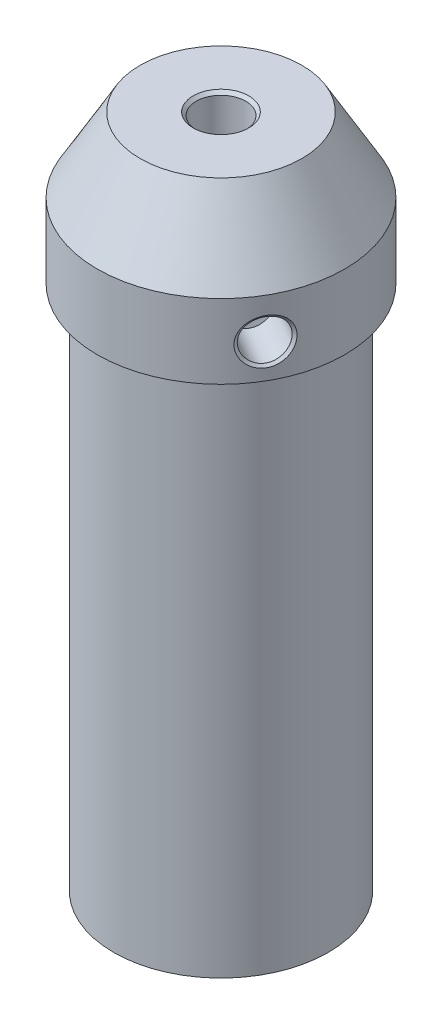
ISO-10303-21;
HEADER;
FILE_DESCRIPTION(('STEP AP214'),'2;1');
FILE_NAME('part.step','',(''),(''),'','','');
FILE_SCHEMA(('AUTOMOTIVE_DESIGN { 1 0 10303 214 1 1 1 1 }'));
ENDSEC;
DATA;
#1=APPLICATION_CONTEXT('core data for automotive mechanical design processes');
#2=APPLICATION_PROTOCOL_DEFINITION('international standard','automotive_design',2000,#1);
#3=PRODUCT_CONTEXT('',#1,'mechanical');
#4=PRODUCT('Part','Part','',(#3));
#5=PRODUCT_RELATED_PRODUCT_CATEGORY('part','',(#4));
#6=PRODUCT_DEFINITION_FORMATION('','',#4);
#7=PRODUCT_DEFINITION_CONTEXT('part definition',#1,'design');
#8=PRODUCT_DEFINITION('design','',#6,#7);
#9=PRODUCT_DEFINITION_SHAPE('','',#8);
#10=(LENGTH_UNIT() NAMED_UNIT(*) SI_UNIT(.MILLI.,.METRE.));
#11=(NAMED_UNIT(*) PLANE_ANGLE_UNIT() SI_UNIT($,.RADIAN.));
#12=(NAMED_UNIT(*) SI_UNIT($,.STERADIAN.) SOLID_ANGLE_UNIT());
#13=UNCERTAINTY_MEASURE_WITH_UNIT(LENGTH_MEASURE(1.E-05),#10,'distance_accuracy_value','');
#14=(GEOMETRIC_REPRESENTATION_CONTEXT(3) GLOBAL_UNCERTAINTY_ASSIGNED_CONTEXT((#13)) GLOBAL_UNIT_ASSIGNED_CONTEXT((#10,
#11,#12)) REPRESENTATION_CONTEXT('',''));
#15=CARTESIAN_POINT('',(0.,0.,0.));
#16=DIRECTION('',(0.,0.,1.));
#17=DIRECTION('',(1.,0.,0.));
#18=AXIS2_PLACEMENT_3D('',#15,#16,#17);
#19=CARTESIAN_POINT('',(0.,0.,0.));
#20=DIRECTION('',(0.,-1.,0.));
#21=DIRECTION('',(0.,0.,-1.));
#22=AXIS2_PLACEMENT_3D('',#19,#20,#21);
#23=PLANE('',#22);
#24=CARTESIAN_POINT('',(0.,0.,0.));
#25=DIRECTION('',(0.,1.,0.));
#26=DIRECTION('',(0.,0.,1.));
#27=AXIS2_PLACEMENT_3D('',#24,#25,#26);
#28=CIRCLE('',#27,17.35);
#29=CARTESIAN_POINT('',(0.,0.,17.35));
#30=VERTEX_POINT('',#29);
#31=EDGE_CURVE('E244',#30,#30,#28,.T.);
#32=ORIENTED_EDGE('',*,*,#31,.F.);
#33=EDGE_LOOP('',(#32));
#34=FACE_BOUND('',#33,.T.);
#35=CARTESIAN_POINT('',(0.,0.,0.));
#36=DIRECTION('',(0.,1.,0.));
#37=DIRECTION('',(0.,0.,1.));
#38=AXIS2_PLACEMENT_3D('',#35,#36,#37);
#39=CIRCLE('',#38,12.5);
#40=CARTESIAN_POINT('',(0.,0.,12.5));
#41=VERTEX_POINT('',#40);
#42=EDGE_CURVE('E206',#41,#41,#39,.T.);
#43=ORIENTED_EDGE('',*,*,#42,.T.);
#44=EDGE_LOOP('',(#43));
#45=FACE_BOUND('',#44,.T.);
#46=ADVANCED_FACE('F30',(#34,#45),#23,.T.);
#47=CARTESIAN_POINT('',(-20.,109.,0.));
#48=DIRECTION('',(0.,1.,0.));
#49=DIRECTION('',(0.,0.,1.));
#50=AXIS2_PLACEMENT_3D('',#47,#48,#49);
#51=PLANE('',#50);
#52=CARTESIAN_POINT('',(0.,109.,0.));
#53=DIRECTION('',(0.,1.,0.));
#54=DIRECTION('',(0.,0.,1.));
#55=AXIS2_PLACEMENT_3D('',#52,#53,#54);
#56=CIRCLE('',#55,4.49999999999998);
#57=CARTESIAN_POINT('',(0.,109.,4.49999999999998));
#58=VERTEX_POINT('',#57);
#59=EDGE_CURVE('E10',#58,#58,#56,.F.);
#60=ORIENTED_EDGE('',*,*,#59,.T.);
#61=EDGE_LOOP('',(#60));
#62=FACE_BOUND('',#61,.T.);
#63=CARTESIAN_POINT('',(0.,109.,0.));
#64=DIRECTION('',(0.,1.,0.));
#65=DIRECTION('',(0.,0.,1.));
#66=AXIS2_PLACEMENT_3D('',#63,#64,#65);
#67=CIRCLE('',#66,13.0717967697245);
#68=CARTESIAN_POINT('',(0.,109.,13.0717967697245));
#69=VERTEX_POINT('',#68);
#70=EDGE_CURVE('E232',#69,#69,#67,.T.);
#71=ORIENTED_EDGE('',*,*,#70,.T.);
#72=EDGE_LOOP('',(#71));
#73=FACE_BOUND('',#72,.T.);
#74=ADVANCED_FACE('F108',(#62,#73),#51,.T.);
#75=CARTESIAN_POINT('',(0.,143.909241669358,0.));
#76=DIRECTION('',(0.,1.,0.));
#77=DIRECTION('',(0.,0.,1.));
#78=AXIS2_PLACEMENT_3D('',#75,#76,#77);
#79=CYLINDRICAL_SURFACE('',#78,20.);
#80=CARTESIAN_POINT('',(-18.8837475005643,90.4999999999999,6.58817731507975));
#81=CARTESIAN_POINT('',(-18.8837124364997,89.5347721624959,6.58826451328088));
#82=CARTESIAN_POINT('',(-18.7534221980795,88.5834842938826,6.98006384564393));
#83=CARTESIAN_POINT('',(-18.2260755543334,87.2264998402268,8.26843594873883));
#84=CARTESIAN_POINT('',(-17.8123606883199,86.829754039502,9.14812823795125));
#85=CARTESIAN_POINT('',(-16.8306325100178,86.8302184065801,10.8484470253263));
#86=CARTESIAN_POINT('',(-16.2754158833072,87.2249779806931,11.6474812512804));
#87=CARTESIAN_POINT('',(-15.4215061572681,88.5824773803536,12.7513944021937));
#88=CARTESIAN_POINT('',(-15.1474811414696,89.5304646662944,13.0596178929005));
#89=CARTESIAN_POINT('',(-15.1473242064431,91.4691095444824,13.0598148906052));
#90=CARTESIAN_POINT('',(-15.4211089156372,92.416473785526,12.7518501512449));
#91=CARTESIAN_POINT('',(-16.2747521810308,93.7743783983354,11.6484037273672));
#92=CARTESIAN_POINT('',(-16.8305397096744,94.16980568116,10.8486227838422));
#93=CARTESIAN_POINT('',(-17.8123472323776,94.1702219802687,9.14813656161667));
#94=CARTESIAN_POINT('',(-18.2257324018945,93.7738606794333,8.26917398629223));
#95=CARTESIAN_POINT('',(-18.7533108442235,92.417315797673,6.98042799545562));
#96=CARTESIAN_POINT('',(-18.8837825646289,91.4652278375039,6.58809011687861));
#97=CARTESIAN_POINT('',(-18.8837475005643,90.4999999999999,6.58817731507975));
#98=B_SPLINE_CURVE_WITH_KNOTS('',3,(#80,#81,#82,#83,#84,#85,#86,#87,#88,#89,#90,#91,#92,#93,#94,
#95,#96,#97),.UNSPECIFIED.,.T.,.F.,(4,2,2,2,2,2,2,2,4),(-6.89288926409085E-06,
0.00286796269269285,0.0057428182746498,0.00861767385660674,0.0114925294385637,
0.0143673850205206,0.0172422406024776,0.0201170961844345,0.0229919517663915),.UNSPECIFIED.);
#99=CARTESIAN_POINT('',(-18.8837475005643,90.4999999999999,6.58817731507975));
#100=VERTEX_POINT('',#99);
#101=EDGE_CURVE('E41',#100,#100,#98,.F.);
#102=ORIENTED_EDGE('',*,*,#101,.T.);
#103=EDGE_LOOP('',(#102));
#104=FACE_BOUND('',#103,.T.);
#105=CARTESIAN_POINT('',(15.1474026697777,90.4999999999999,13.0597163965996));
#106=CARTESIAN_POINT('',(15.1474606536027,89.5347721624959,13.0596424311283));
#107=CARTESIAN_POINT('',(15.4216237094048,88.5834842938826,12.7509081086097));
#108=CARTESIAN_POINT('',(16.2737133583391,87.2264998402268,11.6500264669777));
#109=CARTESIAN_POINT('',(16.8286917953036,86.829754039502,10.8518927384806));
#110=CARTESIAN_POINT('',(17.8103469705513,86.8302184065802,9.15153180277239));
#111=CARTESIAN_POINT('',(18.2247225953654,87.2249779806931,8.2711829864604));
#112=CARTESIAN_POINT('',(18.7537845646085,88.5824773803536,6.97971889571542));
#113=CARTESIAN_POINT('',(18.8837014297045,89.5304646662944,6.58829452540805));
#114=CARTESIAN_POINT('',(18.883793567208,91.4691095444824,6.58806011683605));
#115=CARTESIAN_POINT('',(18.7539806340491,92.4164737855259,6.97914699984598));
#116=CARTESIAN_POINT('',(18.2251896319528,93.7743783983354,8.27014696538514));
#117=CARTESIAN_POINT('',(17.8104527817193,94.1698056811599,9.15136355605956));
#118=CARTESIAN_POINT('',(16.8286922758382,94.1702219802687,10.85187692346));
#119=CARTESIAN_POINT('',(16.2741809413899,93.7738606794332,11.6493602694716));
#120=CARTESIAN_POINT('',(15.4218833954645,92.417315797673,12.7506295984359));
#121=CARTESIAN_POINT('',(15.1473446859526,91.4652278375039,13.0597903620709));
#122=CARTESIAN_POINT('',(15.1474026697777,90.4999999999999,13.0597163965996));
#123=B_SPLINE_CURVE_WITH_KNOTS('',3,(#105,#106,#107,#108,#109,#110,#111,#112,#113,#114,#115,
#116,#117,#118,#119,#120,#121,#122),.UNSPECIFIED.,.T.,.F.,(4,2,2,2,2,2,2,2,4),
(-6.8928892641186E-06,0.0028679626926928,0.00574281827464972,0.00861767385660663,
0.0114925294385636,0.0143673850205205,0.0172422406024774,0.0201170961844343,0.0229919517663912),.UNSPECIFIED.);
#124=CARTESIAN_POINT('',(15.1474026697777,90.4999999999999,13.0597163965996));
#125=VERTEX_POINT('',#124);
#126=EDGE_CURVE('E147',#125,#125,#123,.F.);
#127=ORIENTED_EDGE('',*,*,#126,.T.);
#128=EDGE_LOOP('',(#127));
#129=FACE_BOUND('',#128,.T.);
#130=CARTESIAN_POINT('',(3.73634483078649,90.4999999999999,-19.6478937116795));
#131=CARTESIAN_POINT('',(3.73625178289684,89.5347721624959,-19.6479069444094));
#132=CARTESIAN_POINT('',(3.33179848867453,88.5834842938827,-19.7309719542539));
#133=CARTESIAN_POINT('',(1.95236219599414,87.2264998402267,-19.9184624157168));
#134=CARTESIAN_POINT('',(0.983668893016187,86.8297540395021,-20.000020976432));
#135=CARTESIAN_POINT('',(-0.979714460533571,86.8302184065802,-19.9999788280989));
#136=CARTESIAN_POINT('',(-1.94930671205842,87.2249779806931,-19.918664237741));
#137=CARTESIAN_POINT('',(-3.33227840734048,88.5824773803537,-19.7311132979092));
#138=CARTESIAN_POINT('',(-3.73622028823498,89.5304646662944,-19.6479124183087));
#139=CARTESIAN_POINT('',(-3.73646936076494,91.4691095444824,-19.6478750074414));
#140=CARTESIAN_POINT('',(-3.33287171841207,92.4164737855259,-19.7309971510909));
#141=CARTESIAN_POINT('',(-1.95043745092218,93.7743783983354,-19.9185506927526));
#142=CARTESIAN_POINT('',(-0.979913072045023,94.1698056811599,-19.999986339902));
#143=CARTESIAN_POINT('',(0.983654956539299,94.1702219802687,-20.0000134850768));
#144=CARTESIAN_POINT('',(1.95155146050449,93.7738606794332,-19.9185342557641));
#145=CARTESIAN_POINT('',(3.33142744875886,92.417315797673,-19.7310575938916));
#146=CARTESIAN_POINT('',(3.73643787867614,91.4652278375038,-19.6478804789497));
#147=CARTESIAN_POINT('',(3.73634483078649,90.4999999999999,-19.6478937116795));
#148=B_SPLINE_CURVE_WITH_KNOTS('',3,(#130,#131,#132,#133,#134,#135,#136,#137,#138,#139,#140,
#141,#142,#143,#144,#145,#146,#147),.UNSPECIFIED.,.T.,.F.,(4,2,2,2,2,2,2,2,4),
(-6.89288926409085E-06,0.00286796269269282,0.00574281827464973,0.00861767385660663,
0.0114925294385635,0.0143673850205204,0.0172422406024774,0.0201170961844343,0.0229919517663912),.UNSPECIFIED.);
#149=CARTESIAN_POINT('',(3.73634483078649,90.4999999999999,-19.6478937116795));
#150=VERTEX_POINT('',#149);
#151=EDGE_CURVE('E226',#150,#150,#148,.F.);
#152=ORIENTED_EDGE('',*,*,#151,.T.);
#153=EDGE_LOOP('',(#152));
#154=FACE_BOUND('',#153,.T.);
#155=CARTESIAN_POINT('',(0.,96.9999999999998,0.));
#156=DIRECTION('',(0.,1.,0.));
#157=DIRECTION('',(0.,0.,1.));
#158=AXIS2_PLACEMENT_3D('',#155,#156,#157);
#159=CIRCLE('',#158,20.);
#160=CARTESIAN_POINT('',(0.,96.9999999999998,20.));
#161=VERTEX_POINT('',#160);
#162=EDGE_CURVE('E207',#161,#161,#159,.F.);
#163=ORIENTED_EDGE('',*,*,#162,.T.);
#164=EDGE_LOOP('',(#163));
#165=FACE_BOUND('',#164,.T.);
#166=CARTESIAN_POINT('',(0.,84.9999999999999,0.));
#167=DIRECTION('',(0.,1.,0.));
#168=DIRECTION('',(0.,0.,1.));
#169=AXIS2_PLACEMENT_3D('',#166,#167,#168);
#170=CIRCLE('',#169,20.);
#171=CARTESIAN_POINT('',(0.,84.9999999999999,20.));
#172=VERTEX_POINT('',#171);
#173=EDGE_CURVE('E235',#172,#172,#170,.T.);
#174=ORIENTED_EDGE('',*,*,#173,.T.);
#175=EDGE_LOOP('',(#174));
#176=FACE_BOUND('',#175,.T.);
#177=ADVANCED_FACE('F97',(#104,#129,#154,#165,#176),#79,.T.);
#178=CARTESIAN_POINT('',(-17.35,84.9999999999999,0.));
#179=DIRECTION('',(0.,-1.,0.));
#180=DIRECTION('',(0.,0.,-1.));
#181=AXIS2_PLACEMENT_3D('',#178,#179,#180);
#182=PLANE('',#181);
#183=CARTESIAN_POINT('',(0.,84.9999999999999,0.));
#184=DIRECTION('',(0.,1.,0.));
#185=DIRECTION('',(0.,0.,1.));
#186=AXIS2_PLACEMENT_3D('',#183,#184,#185);
#187=CIRCLE('',#186,17.35);
#188=CARTESIAN_POINT('',(0.,84.9999999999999,17.35));
#189=VERTEX_POINT('',#188);
#190=EDGE_CURVE('E239',#189,#189,#187,.T.);
#191=ORIENTED_EDGE('',*,*,#190,.T.);
#192=EDGE_LOOP('',(#191));
#193=FACE_BOUND('',#192,.T.);
#194=ORIENTED_EDGE('',*,*,#173,.F.);
#195=EDGE_LOOP('',(#194));
#196=FACE_BOUND('',#195,.T.);
#197=ADVANCED_FACE('F107',(#193,#196),#182,.T.);
#198=CARTESIAN_POINT('',(0.,143.909241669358,0.));
#199=DIRECTION('',(0.,1.,0.));
#200=DIRECTION('',(0.,0.,1.));
#201=AXIS2_PLACEMENT_3D('',#198,#199,#200);
#202=CYLINDRICAL_SURFACE('',#201,17.35);
#203=ORIENTED_EDGE('',*,*,#31,.T.);
#204=EDGE_LOOP('',(#203));
#205=FACE_BOUND('',#204,.T.);
#206=ORIENTED_EDGE('',*,*,#190,.F.);
#207=EDGE_LOOP('',(#206));
#208=FACE_BOUND('',#207,.T.);
#209=ADVANCED_FACE('F196',(#205,#208),#202,.T.);
#210=CARTESIAN_POINT('',(0.,109.,0.));
#211=DIRECTION('',(0.,-1.,0.));
#212=DIRECTION('',(0.,0.,-1.));
#213=AXIS2_PLACEMENT_3D('',#210,#211,#212);
#214=CONICAL_SURFACE('',#213,13.0717967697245,0.523598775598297);
#215=ORIENTED_EDGE('',*,*,#162,.F.);
#216=EDGE_LOOP('',(#215));
#217=FACE_BOUND('',#216,.T.);
#218=ORIENTED_EDGE('',*,*,#70,.F.);
#219=EDGE_LOOP('',(#218));
#220=FACE_BOUND('',#219,.T.);
#221=ADVANCED_FACE('F194',(#217,#220),#214,.T.);
#222=CARTESIAN_POINT('',(0.,97.9999999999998,0.));
#223=DIRECTION('',(0.,-1.,0.));
#224=DIRECTION('',(0.,0.,-1.));
#225=AXIS2_PLACEMENT_3D('',#222,#223,#224);
#226=CYLINDRICAL_SURFACE('',#225,12.5);
#227=CARTESIAN_POINT('',(8.82801989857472,90.4999999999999,8.84963641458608));
#228=CARTESIAN_POINT('',(8.82802503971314,90.6792114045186,8.84963401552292));
#229=CARTESIAN_POINT('',(8.83895101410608,90.8584728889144,8.83877293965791));
#230=CARTESIAN_POINT('',(8.88198925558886,91.211830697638,8.79551967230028));
#231=CARTESIAN_POINT('',(8.9141128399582,91.3859242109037,8.7631159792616));
#232=CARTESIAN_POINT('',(8.99756208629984,91.7237835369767,8.6774087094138));
#233=CARTESIAN_POINT('',(9.04886164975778,91.8875630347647,8.62413353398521));
#234=CARTESIAN_POINT('',(9.16784060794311,92.2007764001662,8.49754158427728));
#235=CARTESIAN_POINT('',(9.2355210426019,92.3502093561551,8.42422353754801));
#236=CARTESIAN_POINT('',(9.38548187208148,92.634042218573,8.256851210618));
#237=CARTESIAN_POINT('',(9.46804456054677,92.7680504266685,8.16238547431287));
#238=CARTESIAN_POINT('',(9.64282924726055,93.0137719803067,7.95513611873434));
#239=CARTESIAN_POINT('',(9.73505220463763,93.1254831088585,7.84235067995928));
#240=CARTESIAN_POINT('',(9.92655057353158,93.3250602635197,7.59854892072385));
#241=CARTESIAN_POINT('',(10.0259117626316,93.4125387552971,7.4672819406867));
#242=CARTESIAN_POINT('',(10.2261566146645,93.5586431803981,7.19060762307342));
#243=CARTESIAN_POINT('',(10.3270400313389,93.6172737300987,7.04520255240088));
#244=CARTESIAN_POINT('',(10.524114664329,93.7027555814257,6.74716359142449));
#245=CARTESIAN_POINT('',(10.6203602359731,93.7302727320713,6.59475682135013));
#246=CARTESIAN_POINT('',(10.8070864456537,93.754839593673,6.28408352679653));
#247=CARTESIAN_POINT('',(10.8975680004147,93.7518941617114,6.12581794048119));
#248=CARTESIAN_POINT('',(11.0680428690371,93.7160924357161,5.81201924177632));
#249=CARTESIAN_POINT('',(11.1482356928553,93.6839552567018,5.65651163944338));
#250=CARTESIAN_POINT('',(11.2989529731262,93.5918416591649,5.34911060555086));
#251=CARTESIAN_POINT('',(11.3694768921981,93.531863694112,5.19721737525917));
#252=CARTESIAN_POINT('',(11.5006244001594,93.3852075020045,4.9002313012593));
#253=CARTESIAN_POINT('',(11.5611466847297,93.2982790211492,4.75521753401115));
#254=CARTESIAN_POINT('',(11.6713150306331,93.1003805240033,4.47802256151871));
#255=CARTESIAN_POINT('',(11.7209590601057,92.9894060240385,4.34584375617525));
#256=CARTESIAN_POINT('',(11.8110223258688,92.7427328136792,4.09488300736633));
#257=CARTESIAN_POINT('',(11.8511296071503,92.60640638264,3.97660541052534));
#258=CARTESIAN_POINT('',(11.9209087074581,92.3148939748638,3.76227011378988));
#259=CARTESIAN_POINT('',(11.9505799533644,92.1597069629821,3.66621363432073));
#260=CARTESIAN_POINT('',(12.000436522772,91.8336433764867,3.49959479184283));
#261=CARTESIAN_POINT('',(12.0205676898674,91.6626836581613,3.42917849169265));
#262=CARTESIAN_POINT('',(12.0518122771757,91.3106702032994,3.31771136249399));
#263=CARTESIAN_POINT('',(12.062927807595,91.1296188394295,3.2766536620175));
#264=CARTESIAN_POINT('',(12.0764184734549,90.7680861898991,3.22657333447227));
#265=CARTESIAN_POINT('',(12.0790334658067,90.5877354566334,3.21667184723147));
#266=CARTESIAN_POINT('',(12.0763088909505,90.2279597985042,3.22688583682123));
#267=CARTESIAN_POINT('',(12.0709701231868,90.0485347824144,3.24699829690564));
#268=CARTESIAN_POINT('',(12.0522873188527,89.6990480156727,3.31565755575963));
#269=CARTESIAN_POINT('',(12.0390893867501,89.5288757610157,3.36368502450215));
#270=CARTESIAN_POINT('',(12.0043252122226,89.1990276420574,3.48571016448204));
#271=CARTESIAN_POINT('',(11.9827579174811,89.0393531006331,3.55971110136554));
#272=CARTESIAN_POINT('',(11.9300403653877,88.731327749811,3.73261915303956));
#273=CARTESIAN_POINT('',(11.898698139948,88.5832856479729,3.83201725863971));
#274=CARTESIAN_POINT('',(11.8258353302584,88.3060537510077,4.05128862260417));
#275=CARTESIAN_POINT('',(11.7843129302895,88.1768673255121,4.17116553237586));
#276=CARTESIAN_POINT('',(11.6891733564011,87.9373926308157,4.43089546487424));
#277=CARTESIAN_POINT('',(11.6352568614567,87.8277167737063,4.57120460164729));
#278=CARTESIAN_POINT('',(11.5157205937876,87.6348486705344,4.86448524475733));
#279=CARTESIAN_POINT('',(11.4501014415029,87.551655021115,5.01745607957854));
#280=CARTESIAN_POINT('',(11.3080579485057,87.4148614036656,5.32982294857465));
#281=CARTESIAN_POINT('',(11.231718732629,87.3610432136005,5.48916189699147));
#282=CARTESIAN_POINT('',(11.0690943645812,87.2838854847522,5.81011839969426));
#283=CARTESIAN_POINT('',(10.9828113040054,87.2605395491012,5.9717354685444));
#284=CARTESIAN_POINT('',(10.8051107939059,87.2453732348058,6.28740310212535));
#285=CARTESIAN_POINT('',(10.7139167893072,87.25265235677,6.44153681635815));
#286=CARTESIAN_POINT('',(10.5269774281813,87.2964501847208,6.74271184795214));
#287=CARTESIAN_POINT('',(10.4312322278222,87.3329678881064,6.88975340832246));
#288=CARTESIAN_POINT('',(10.2391416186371,87.4337074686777,7.17209731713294));
#289=CARTESIAN_POINT('',(10.1428037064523,87.4977546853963,7.30746732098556));
#290=CARTESIAN_POINT('',(9.95252412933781,87.6515784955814,7.56458025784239));
#291=CARTESIAN_POINT('',(9.85858278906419,87.7413585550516,7.6863213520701));
#292=CARTESIAN_POINT('',(9.67448483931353,87.9467801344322,7.91686050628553));
#293=CARTESIAN_POINT('',(9.58448650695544,88.0630244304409,8.02524783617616));
#294=CARTESIAN_POINT('',(9.41487800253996,88.3169204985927,8.22357206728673));
#295=CARTESIAN_POINT('',(9.33527052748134,88.4545778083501,8.31350418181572));
#296=CARTESIAN_POINT('',(9.18877755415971,88.750806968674,8.47517202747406));
#297=CARTESIAN_POINT('',(9.12218811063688,88.9097514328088,8.54649447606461));
#298=CARTESIAN_POINT('',(9.00753012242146,89.2419180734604,8.66725923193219));
#299=CARTESIAN_POINT('',(8.95944890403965,89.4151303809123,8.71671651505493));
#300=CARTESIAN_POINT('',(8.89117632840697,89.7398703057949,8.78629101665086));
#301=CARTESIAN_POINT('',(8.867588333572,89.8899285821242,8.81001550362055));
#302=CARTESIAN_POINT('',(8.8360087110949,90.193312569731,8.84168842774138));
#303=CARTESIAN_POINT('',(8.82801549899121,90.3466379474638,8.84963846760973));
#304=CARTESIAN_POINT('',(8.82801989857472,90.4999999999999,8.84963641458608));
#305=B_SPLINE_CURVE_WITH_KNOTS('',3,(#227,#228,#229,#230,#231,#232,#233,#234,#235,#236,#237,
#238,#239,#240,#241,#242,#243,#244,#245,#246,#247,#248,#249,#250,#251,#252,#253,#254,#255,#256,
#257,#258,#259,#260,#261,#262,#263,#264,#265,#266,#267,#268,#269,#270,#271,#272,#273,#274,#275,
#276,#277,#278,#279,#280,#281,#282,#283,#284,#285,#286,#287,#288,#289,#290,#291,#292,#293,#294,
#295,#296,#297,#298,#299,#300,#301,#302,#303,#304),.UNSPECIFIED.,.T.,.F.,(4,2,2,2,2,2,2,2,2,2,2,
2,2,2,2,2,2,2,2,2,2,2,2,2,2,2,2,2,2,2,2,2,2,2,2,2,2,2,4),(0.,0.537070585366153,1.07442814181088,
1.61105700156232,2.14771993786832,2.69590642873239,3.24414739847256,3.80070711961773,
4.35717774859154,4.90149970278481,5.44573486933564,5.97691640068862,6.50812744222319,
7.04442685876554,7.58082636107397,8.1329003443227,8.68500464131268,9.2402066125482,
9.79527859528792,10.3345457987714,10.8737588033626,11.4032475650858,11.9328029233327,
12.4734934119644,13.0142804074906,13.5698352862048,14.1253607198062,14.6767011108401,
15.2279257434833,15.7630571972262,16.2981703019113,16.8299373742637,17.3617761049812,
17.9072189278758,18.4528030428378,19.0096330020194,19.5660809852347,20.0257315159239,
20.4853353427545),.UNSPECIFIED.);
#306=CARTESIAN_POINT('',(8.82801989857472,90.4999999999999,8.84963641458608));
#307=VERTEX_POINT('',#306);
#308=EDGE_CURVE('E182',#307,#307,#305,.T.);
#309=ORIENTED_EDGE('',*,*,#308,.F.);
#310=EDGE_LOOP('',(#309));
#311=FACE_BOUND('',#310,.T.);
#312=CARTESIAN_POINT('',(-12.0780198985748,90.4999999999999,3.22047128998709));
#313=CARTESIAN_POINT('',(-12.0780203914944,90.6792114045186,3.22047694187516));
#314=CARTESIAN_POINT('',(-12.0740774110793,90.8584728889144,3.23536965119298));
#315=CARTESIAN_POINT('',(-12.0581381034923,91.2118306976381,3.2942684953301));
#316=CARTESIAN_POINT('',(-12.046137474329,91.3859242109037,3.33829018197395));
#317=CARTESIAN_POINT('',(-12.0136374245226,91.7237835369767,3.45341298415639));
#318=CARTESIAN_POINT('',(-11.9931495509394,91.8875630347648,3.52447729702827));
#319=CARTESIAN_POINT('',(-11.9430071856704,92.2007764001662,3.69081207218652));
#320=CARTESIAN_POINT('',(-11.9133521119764,92.3502093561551,3.78608407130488));
#321=CARTESIAN_POINT('',(-11.8433838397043,92.6340422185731,3.99964012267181));
#322=CARTESIAN_POINT('',(-11.8028554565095,92.7680504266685,4.11837437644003));
#323=CARTESIAN_POINT('',(-11.7107645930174,93.0137719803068,4.37336703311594));
#324=CARTESIAN_POINT('',(-11.6592010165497,93.1254831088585,4.50962717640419));
#325=CARTESIAN_POINT('',(-11.5438116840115,93.3250602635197,4.79737050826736));
#326=CARTESIAN_POINT('',(-11.4798117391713,93.4125387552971,4.94905331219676));
#327=CARTESIAN_POINT('',(-11.3403271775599,93.5586431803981,5.26080759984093));
#328=CARTESIAN_POINT('',(-11.2648444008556,93.6172737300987,5.42087773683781));
#329=CARTESIAN_POINT('',(-11.1052724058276,93.7027555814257,5.74056885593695));
#330=CARTESIAN_POINT('',(-11.0214070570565,93.7302727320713,5.90012335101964));
#331=CARTESIAN_POINT('',(-10.845719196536,93.754839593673,6.21716963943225));
#332=CARTESIAN_POINT('',(-10.7538979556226,93.7518941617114,6.37466175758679));
#333=CARTESIAN_POINT('',(-10.5673777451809,93.7160924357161,6.67919667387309));
#334=CARTESIAN_POINT('',(-10.472800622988,93.6839552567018,6.8263994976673));
#335=CARTESIAN_POINT('',(-10.2819421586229,93.5918416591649,7.11062500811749));
#336=CARTESIAN_POINT('',(-10.1856607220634,93.531863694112,7.24764712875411));
#337=CARTESIAN_POINT('',(-9.99403699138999,93.3852075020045,7.50971723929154));
#338=CARTESIAN_POINT('',(-9.89871252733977,93.2982790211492,7.63463795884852));
#339=CARTESIAN_POINT('',(-9.71373881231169,93.1003805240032,7.86864403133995));
#340=CARTESIAN_POINT('',(-9.62409062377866,92.9894060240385,7.9777264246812));
#341=CARTESIAN_POINT('',(-9.45178387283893,92.7427328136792,8.18120387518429));
#342=CARTESIAN_POINT('',(-9.36940610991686,92.60640638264,8.2750765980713));
#343=CARTESIAN_POINT('',(-9.21867584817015,92.3148939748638,8.44267471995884));
#344=CARTESIAN_POINT('',(-9.15032411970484,92.1597069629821,8.51639901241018));
#345=CARTESIAN_POINT('',(-9.03095625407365,91.8336433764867,8.64288548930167));
#346=CARTESIAN_POINT('',(-8.98003953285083,91.6626836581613,8.69552774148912));
#347=CARTESIAN_POINT('',(-8.89912846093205,91.3106702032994,8.77831991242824));
#348=CARTESIAN_POINT('',(-8.86912921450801,91.1296188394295,8.80847509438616));
#349=CARTESIAN_POINT('',(-8.83250371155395,90.7680861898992,8.84519851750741));
#350=CARTESIAN_POINT('',(-8.82523626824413,90.5877354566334,8.8524139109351));
#351=CARTESIAN_POINT('',(-8.83271955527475,90.2279597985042,8.84494736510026));
#352=CARTESIAN_POINT('',(-8.84746807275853,90.0485347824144,8.83026762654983));
#353=CARTESIAN_POINT('',(-8.89758733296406,89.6990480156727,8.77975821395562));
#354=CARTESIAN_POINT('',(-8.93258137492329,89.5288757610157,8.74431473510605));
#355=CARTESIAN_POINT('',(-9.02087615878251,89.1990276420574,8.65319550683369));
#356=CARTESIAN_POINT('',(-9.07417920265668,89.0393531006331,8.59751721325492));
#357=CARTESIAN_POINT('',(-9.19756319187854,88.731327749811,8.4654084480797));
#358=CARTESIAN_POINT('',(-9.26797336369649,88.5832856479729,8.38856623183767));
#359=CARTESIAN_POINT('',(-9.42143653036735,88.3060537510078,8.2158295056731));
#360=CARTESIAN_POINT('',(-9.50449177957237,88.1768673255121,8.11993159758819));
#361=CARTESIAN_POINT('',(-9.68185471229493,87.9373926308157,7.90767334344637));
#362=CARTESIAN_POINT('',(-9.77640774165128,87.8277167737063,7.79082572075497));
#363=CARTESIAN_POINT('',(-9.97062809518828,87.6348486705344,7.5406639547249));
#364=CARTESIAN_POINT('',(-10.0702951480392,87.551655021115,7.40735068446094));
#365=CARTESIAN_POINT('',(-10.2697910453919,87.4148614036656,7.12815397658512));
#366=CARTESIAN_POINT('',(-10.3696130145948,87.3610432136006,6.98237280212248));
#367=CARTESIAN_POINT('',(-10.5662573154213,87.2838854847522,6.6810577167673));
#368=CARTESIAN_POINT('',(-10.6630802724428,87.2605395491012,6.52552585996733));
#369=CARTESIAN_POINT('',(-10.8476062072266,87.2453732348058,6.21379888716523));
#370=CARTESIAN_POINT('',(-10.9354929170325,87.25265235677,6.05775570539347));
#371=CARTESIAN_POINT('',(-11.1028484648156,87.2964501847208,5.74527395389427));
#372=CARTESIAN_POINT('',(-11.1823175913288,87.3329678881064,5.58883539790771));
#373=CARTESIAN_POINT('',(-11.3307892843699,87.4337074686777,5.28130809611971));
#374=CARTESIAN_POINT('',(-11.3998541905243,87.4977546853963,5.1301920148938));
#375=CARTESIAN_POINT('',(-11.5273807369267,87.6515784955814,4.83684859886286));
#376=CARTESIAN_POINT('',(-11.5858409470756,87.7413585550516,4.69462246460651));
#377=CARTESIAN_POINT('',(-11.6934447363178,87.9467801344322,4.41991938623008));
#378=CARTESIAN_POINT('',(-11.7423117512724,88.0630244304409,4.28778487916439));
#379=CARTESIAN_POINT('',(-11.8292613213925,88.3169204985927,4.04173749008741));
#380=CARTESIAN_POINT('',(-11.8673410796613,88.4545778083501,3.92782933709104));
#381=CARTESIAN_POINT('',(-11.9341030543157,88.750806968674,3.72012877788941));
#382=CARTESIAN_POINT('',(-11.9625753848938,88.9097514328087,3.62679940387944));
#383=CARTESIAN_POINT('',(-12.0098317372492,89.2419180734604,3.46712029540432));
#384=CARTESIAN_POINT('',(-12.0286223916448,89.4151303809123,3.40075209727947));
#385=CARTESIAN_POINT('',(-12.0547393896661,89.7398703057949,3.30683906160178));
#386=CARTESIAN_POINT('',(-12.0634914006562,89.8899285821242,3.27454901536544));
#387=CARTESIAN_POINT('',(-12.0751311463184,90.1933125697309,3.23136379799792));
#388=CARTESIAN_POINT('',(-12.0780194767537,90.3466379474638,3.22046645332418));
#389=CARTESIAN_POINT('',(-12.0780198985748,90.4999999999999,3.22047128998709));
#390=B_SPLINE_CURVE_WITH_KNOTS('',3,(#312,#313,#314,#315,#316,#317,#318,#319,#320,#321,#322,
#323,#324,#325,#326,#327,#328,#329,#330,#331,#332,#333,#334,#335,#336,#337,#338,#339,#340,#341,
#342,#343,#344,#345,#346,#347,#348,#349,#350,#351,#352,#353,#354,#355,#356,#357,#358,#359,#360,
#361,#362,#363,#364,#365,#366,#367,#368,#369,#370,#371,#372,#373,#374,#375,#376,#377,#378,#379,
#380,#381,#382,#383,#384,#385,#386,#387,#388,#389),.UNSPECIFIED.,.T.,.F.,(4,2,2,2,2,2,2,2,2,2,2,
2,2,2,2,2,2,2,2,2,2,2,2,2,2,2,2,2,2,2,2,2,2,2,2,2,2,2,4),(0.,0.537070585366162,1.07442814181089,
1.61105700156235,2.14771993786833,2.69590642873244,3.24414739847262,3.80070711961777,
4.35717774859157,4.90149970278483,5.44573486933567,5.97691640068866,6.50812744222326,
7.04442685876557,7.58082636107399,8.13290034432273,8.68500464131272,9.24020661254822,
9.79527859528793,10.3345457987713,10.8737588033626,11.4032475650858,11.9328029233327,
12.4734934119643,13.0142804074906,13.5698352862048,14.1253607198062,14.6767011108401,
15.2279257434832,15.7630571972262,16.2981703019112,16.8299373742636,17.3617761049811,
17.9072189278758,18.4528030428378,19.0096330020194,19.5660809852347,20.0257315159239,
20.4853353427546),.UNSPECIFIED.);
#391=CARTESIAN_POINT('',(-12.0780198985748,90.4999999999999,3.22047128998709));
#392=VERTEX_POINT('',#391);
#393=EDGE_CURVE('E50',#392,#392,#390,.T.);
#394=ORIENTED_EDGE('',*,*,#393,.F.);
#395=EDGE_LOOP('',(#394));
#396=FACE_BOUND('',#395,.T.);
#397=CARTESIAN_POINT('',(0.,93.7499999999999,-12.5));
#398=CARTESIAN_POINT('',(-0.179326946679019,93.7499954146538,-12.4999971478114));
#399=CARTESIAN_POINT('',(-0.358703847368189,93.735107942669,-12.4961028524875));
#400=CARTESIAN_POINT('',(-0.71230103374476,93.6760501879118,-12.4809455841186));
#401=CARTESIAN_POINT('',(-0.88651861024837,93.6318647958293,-12.4696788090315));
#402=CARTESIAN_POINT('',(-1.22464113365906,93.5157367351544,-12.4410217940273));
#403=CARTESIAN_POINT('',(-1.3885587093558,93.4438288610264,-12.4236392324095));
#404=CARTESIAN_POINT('',(-1.70200619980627,93.2744233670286,-12.3845934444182));
#405=CARTESIAN_POINT('',(-1.85153534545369,93.1769243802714,-12.3629299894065));
#406=CARTESIAN_POINT('',(-2.1352713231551,92.9568252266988,-12.3171304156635));
#407=CARTESIAN_POINT('',(-2.2691142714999,92.8337644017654,-12.2929536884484));
#408=CARTESIAN_POINT('',(-2.51451354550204,92.5670201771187,-12.2451168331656));
#409=CARTESIAN_POINT('',(-2.62606714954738,92.4233342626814,-12.2214567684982));
#410=CARTESIAN_POINT('',(-2.82546970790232,92.1165462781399,-12.176919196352));
#411=CARTESIAN_POINT('',(-2.91290475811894,91.9531670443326,-12.1560930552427));
#412=CARTESIAN_POINT('',(-3.0589240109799,91.6133989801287,-12.1201764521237));
#413=CARTESIAN_POINT('',(-3.11751324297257,91.4370124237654,-12.1050849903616));
#414=CARTESIAN_POINT('',(-3.20292307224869,91.0802551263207,-12.0827649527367));
#415=CARTESIAN_POINT('',(-3.23040120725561,90.9000522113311,-12.075373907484));
#416=CARTESIAN_POINT('',(-3.2548580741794,90.5374544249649,-12.0688057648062));
#417=CARTESIAN_POINT('',(-3.25184220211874,90.3550599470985,-12.0696272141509));
#418=CARTESIAN_POINT('',(-3.21591974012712,89.9983507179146,-12.0792455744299));
#419=CARTESIAN_POINT('',(-3.18380381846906,89.8239497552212,-12.0878315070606));
#420=CARTESIAN_POINT('',(-3.09185720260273,89.4831005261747,-12.1116742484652));
#421=CARTESIAN_POINT('',(-3.0320243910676,89.3166528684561,-12.1269315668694));
#422=CARTESIAN_POINT('',(-2.88568619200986,88.9943500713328,-12.1625867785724));
#423=CARTESIAN_POINT('',(-2.79889965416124,88.838628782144,-12.1830384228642));
#424=CARTESIAN_POINT('',(-2.6013138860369,88.5436794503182,-12.2267484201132));
#425=CARTESIAN_POINT('',(-2.49051014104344,88.4044545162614,-12.2500073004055));
#426=CARTESIAN_POINT('',(-2.24397099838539,88.1419269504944,-12.2975934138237));
#427=CARTESIAN_POINT('',(-2.10757029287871,88.0192502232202,-12.3219314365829));
#428=CARTESIAN_POINT('',(-1.81583697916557,87.79838782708,-12.3682867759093));
#429=CARTESIAN_POINT('',(-1.66050369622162,87.7002030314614,-12.3903040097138));
#430=CARTESIAN_POINT('',(-1.33437638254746,87.5308547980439,-12.4296616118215));
#431=CARTESIAN_POINT('',(-1.16352356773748,87.4597998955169,-12.4469831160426));
#432=CARTESIAN_POINT('',(-0.811745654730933,87.3475987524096,-12.4748609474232));
#433=CARTESIAN_POINT('',(-0.63082265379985,87.3064463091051,-12.4854186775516));
#434=CARTESIAN_POINT('',(-0.269385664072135,87.2561900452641,-12.4983690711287));
#435=CARTESIAN_POINT('',(-0.0889976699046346,87.2462347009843,-12.5009786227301));
#436=CARTESIAN_POINT('',(0.270868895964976,87.2563101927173,-12.4983598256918));
#437=CARTESIAN_POINT('',(0.450347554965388,87.2763380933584,-12.4931322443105));
#438=CARTESIAN_POINT('',(0.800294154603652,87.3451116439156,-12.4755662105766));
#439=CARTESIAN_POINT('',(0.97086099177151,87.3933865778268,-12.4633443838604));
#440=CARTESIAN_POINT('',(1.3014621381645,87.5167408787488,-12.4331723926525));
#441=CARTESIAN_POINT('',(1.46149533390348,87.5918230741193,-12.4152216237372));
#442=CARTESIAN_POINT('',(1.76982748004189,87.7682687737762,-12.3750700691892));
#443=CARTESIAN_POINT('',(1.91784830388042,87.8701010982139,-12.3527955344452));
#444=CARTESIAN_POINT('',(2.19500110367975,88.0965630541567,-12.3065732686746));
#445=CARTESIAN_POINT('',(2.32412953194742,88.2211969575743,-12.2826252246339));
#446=CARTESIAN_POINT('',(2.56338832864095,88.4936902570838,-12.2349639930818));
#447=CARTESIAN_POINT('',(2.67291924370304,88.6420810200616,-12.211274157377));
#448=CARTESIAN_POINT('',(2.86553246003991,88.9556325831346,-12.1675189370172));
#449=CARTESIAN_POINT('',(2.948615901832,89.120792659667,-12.1474533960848));
#450=CARTESIAN_POINT('',(3.08535085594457,89.4623402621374,-12.1134461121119));
#451=CARTESIAN_POINT('',(3.13917517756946,89.6386548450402,-12.0994685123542));
#452=CARTESIAN_POINT('',(3.21629359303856,89.9982542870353,-12.0792001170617));
#453=CARTESIAN_POINT('',(3.23959502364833,90.181537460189,-12.0729074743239));
#454=CARTESIAN_POINT('',(3.25459970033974,90.5437495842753,-12.0688703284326));
#455=CARTESIAN_POINT('',(3.24726417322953,90.7226364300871,-12.0708657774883));
#456=CARTESIAN_POINT('',(3.20342074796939,91.0765281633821,-12.082574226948));
#457=CARTESIAN_POINT('',(3.16691353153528,91.2515331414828,-12.092287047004));
#458=CARTESIAN_POINT('',(3.06630741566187,91.591550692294,-12.1181850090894));
#459=CARTESIAN_POINT('',(3.00240268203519,91.7566244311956,-12.134324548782));
#460=CARTESIAN_POINT('',(2.84896725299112,92.0738295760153,-12.1712606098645));
#461=CARTESIAN_POINT('',(2.75943272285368,92.2259590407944,-12.1920578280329));
#462=CARTESIAN_POINT('',(2.55432532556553,92.5175686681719,-12.236695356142));
#463=CARTESIAN_POINT('',(2.43809199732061,92.6565737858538,-12.2606047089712));
#464=CARTESIAN_POINT('',(2.18415516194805,92.91341868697,-12.3083763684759));
#465=CARTESIAN_POINT('',(2.04644649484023,93.0312533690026,-12.3322386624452));
#466=CARTESIAN_POINT('',(1.75013899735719,93.2447253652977,-12.3777986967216));
#467=CARTESIAN_POINT('',(1.59117696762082,93.3398707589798,-12.3994435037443));
#468=CARTESIAN_POINT('',(1.25896025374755,93.5019369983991,-12.4375594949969));
#469=CARTESIAN_POINT('',(1.08571527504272,93.5688768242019,-12.4540341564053));
#470=CARTESIAN_POINT('',(0.760811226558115,93.6634068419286,-12.4776981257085));
#471=CARTESIAN_POINT('',(0.610614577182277,93.6958060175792,-12.4860018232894));
#472=CARTESIAN_POINT('',(0.306957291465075,93.739103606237,-12.4971537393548));
#473=CARTESIAN_POINT('',(0.153496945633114,93.7500039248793,-12.5000024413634));
#474=CARTESIAN_POINT('',(0.,93.7499999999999,-12.5));
#475=B_SPLINE_CURVE_WITH_KNOTS('',3,(#397,#398,#399,#400,#401,#402,#403,#404,#405,#406,#407,
#408,#409,#410,#411,#412,#413,#414,#415,#416,#417,#418,#419,#420,#421,#422,#423,#424,#425,#426,
#427,#428,#429,#430,#431,#432,#433,#434,#435,#436,#437,#438,#439,#440,#441,#442,#443,#444,#445,
#446,#447,#448,#449,#450,#451,#452,#453,#454,#455,#456,#457,#458,#459,#460,#461,#462,#463,#464,
#465,#466,#467,#468,#469,#470,#471,#472,#473,#474),.UNSPECIFIED.,.T.,.F.,(4,2,2,2,2,2,2,2,2,2,2,
2,2,2,2,2,2,2,2,2,2,2,2,2,2,2,2,2,2,2,2,2,2,2,2,2,2,2,4),(0.,0.537418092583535,1.0751135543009,
1.61213634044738,2.14918781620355,2.69692042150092,3.2447198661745,3.8014059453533,
4.35799493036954,4.90258689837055,5.44708250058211,5.97721335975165,6.50738472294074,
7.04328330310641,7.5792827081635,8.13186573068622,8.68446845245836,9.23925930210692,
9.79393503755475,10.3333328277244,10.8726778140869,11.403281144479,11.9339404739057,
12.4746049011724,13.0153707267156,13.570578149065,14.1257616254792,14.6776294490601,
15.2293645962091,15.7639213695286,16.2984656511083,16.8292826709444,17.3601791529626,
17.9059807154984,18.451913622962,19.0087822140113,19.5652754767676,20.0253254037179,
20.485334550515),.UNSPECIFIED.);
#476=CARTESIAN_POINT('',(0.,93.7499999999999,-12.5));
#477=VERTEX_POINT('',#476);
#478=EDGE_CURVE('E200',#477,#477,#475,.T.);
#479=ORIENTED_EDGE('',*,*,#478,.F.);
#480=EDGE_LOOP('',(#479));
#481=FACE_BOUND('',#480,.T.);
#482=CARTESIAN_POINT('',(0.,97.9999999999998,0.));
#483=DIRECTION('',(0.,1.,0.));
#484=DIRECTION('',(0.,0.,1.));
#485=AXIS2_PLACEMENT_3D('',#482,#483,#484);
#486=CIRCLE('',#485,12.5);
#487=CARTESIAN_POINT('',(0.,97.9999999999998,12.5));
#488=VERTEX_POINT('',#487);
#489=EDGE_CURVE('E247',#488,#488,#486,.T.);
#490=ORIENTED_EDGE('',*,*,#489,.T.);
#491=EDGE_LOOP('',(#490));
#492=FACE_BOUND('',#491,.T.);
#493=ORIENTED_EDGE('',*,*,#42,.F.);
#494=EDGE_LOOP('',(#493));
#495=FACE_BOUND('',#494,.T.);
#496=ADVANCED_FACE('F189',(#311,#396,#481,#492,#495),#226,.F.);
#497=CARTESIAN_POINT('',(0.,97.9999999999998,0.));
#498=DIRECTION('',(0.,1.,0.));
#499=DIRECTION('',(0.,0.,1.));
#500=AXIS2_PLACEMENT_3D('',#497,#498,#499);
#501=PLANE('',#500);
#502=CARTESIAN_POINT('',(0.,97.9999999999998,0.));
#503=DIRECTION('',(0.,1.,0.));
#504=DIRECTION('',(0.,0.,1.));
#505=AXIS2_PLACEMENT_3D('',#502,#503,#504);
#506=CIRCLE('',#505,4.);
#507=CARTESIAN_POINT('',(0.,97.9999999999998,4.));
#508=VERTEX_POINT('',#507);
#509=EDGE_CURVE('E47',#508,#508,#506,.T.);
#510=ORIENTED_EDGE('',*,*,#509,.T.);
#511=EDGE_LOOP('',(#510));
#512=FACE_BOUND('',#511,.T.);
#513=ORIENTED_EDGE('',*,*,#489,.F.);
#514=EDGE_LOOP('',(#513));
#515=FACE_BOUND('',#514,.T.);
#516=ADVANCED_FACE('F193',(#512,#515),#501,.F.);
#517=CARTESIAN_POINT('',(0.,90.4999999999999,-91.));
#518=DIRECTION('',(0.,0.,1.));
#519=DIRECTION('',(1.,0.,0.));
#520=AXIS2_PLACEMENT_3D('',#517,#518,#519);
#521=CYLINDRICAL_SURFACE('',#520,3.25);
#522=CARTESIAN_POINT('',(3.24999999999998,90.4999999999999,-19.2990888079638));
#523=CARTESIAN_POINT('',(3.2500061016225,90.5533842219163,-19.29908773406));
#524=CARTESIAN_POINT('',(3.2486356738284,90.6067660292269,-19.2994059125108));
#525=CARTESIAN_POINT('',(3.24318998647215,90.7133257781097,-19.3006464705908));
#526=CARTESIAN_POINT('',(3.23911771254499,90.7665038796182,-19.3015681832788));
#527=CARTESIAN_POINT('',(3.22831978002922,90.8725421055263,-19.3039808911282));
#528=CARTESIAN_POINT('',(3.22159579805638,90.925402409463,-19.3054715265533));
#529=CARTESIAN_POINT('',(3.20554701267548,91.0306929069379,-19.3089868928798));
#530=CARTESIAN_POINT('',(3.19622294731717,91.083123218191,-19.3110114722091));
#531=CARTESIAN_POINT('',(3.17502577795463,91.1874411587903,-19.3155597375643));
#532=CARTESIAN_POINT('',(3.1631527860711,91.2393288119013,-19.3180834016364));
#533=CARTESIAN_POINT('',(3.13690934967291,91.3424490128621,-19.3235948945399));
#534=CARTESIAN_POINT('',(3.1225386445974,91.393681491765,-19.3265827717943));
#535=CARTESIAN_POINT('',(3.09135109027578,91.4953788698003,-19.3329878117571));
#536=CARTESIAN_POINT('',(3.07453380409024,91.5458436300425,-19.3364050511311));
#537=CARTESIAN_POINT('',(3.03850421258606,91.6458930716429,-19.3436339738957));
#538=CARTESIAN_POINT('',(3.019291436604,91.6954775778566,-19.3474457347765));
#539=CARTESIAN_POINT('',(2.9785218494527,91.7936539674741,-19.3554288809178));
#540=CARTESIAN_POINT('',(2.95696462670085,91.8422456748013,-19.3596003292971));
#541=CARTESIAN_POINT('',(2.91155704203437,91.9383238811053,-19.3682680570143));
#542=CARTESIAN_POINT('',(2.88770637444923,91.9858102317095,-19.3727643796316));
#543=CARTESIAN_POINT('',(2.83776274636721,92.0795651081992,-19.3820470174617));
#544=CARTESIAN_POINT('',(2.81166959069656,92.125833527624,-19.3868333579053));
#545=CARTESIAN_POINT('',(2.75729184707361,92.2170399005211,-19.3966613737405));
#546=CARTESIAN_POINT('',(2.72900714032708,92.2619777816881,-19.4017030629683));
#547=CARTESIAN_POINT('',(2.67029712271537,92.3504104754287,-19.4120064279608));
#548=CARTESIAN_POINT('',(2.63987170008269,92.3939052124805,-19.4172681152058));
#549=CARTESIAN_POINT('',(2.57693139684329,92.4793389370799,-19.4279786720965));
#550=CARTESIAN_POINT('',(2.54441631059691,92.5212777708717,-19.4334275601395));
#551=CARTESIAN_POINT('',(2.47734699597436,92.6034875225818,-19.4444701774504));
#552=CARTESIAN_POINT('',(2.44279233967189,92.6437580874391,-19.450063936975));
#553=CARTESIAN_POINT('',(2.37169779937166,92.722517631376,-19.4613895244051));
#554=CARTESIAN_POINT('',(2.33515711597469,92.7610058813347,-19.4671214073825));
#555=CARTESIAN_POINT('',(2.26016378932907,92.8360611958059,-19.4785787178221));
#556=CARTESIAN_POINT('',(2.22171144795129,92.8726285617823,-19.4843041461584));
#557=CARTESIAN_POINT('',(2.1430269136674,92.9437620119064,-19.4956053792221));
#558=CARTESIAN_POINT('',(2.10279596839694,92.9783294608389,-19.501181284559));
#559=CARTESIAN_POINT('',(2.02066965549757,93.0454129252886,-19.5121783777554));
#560=CARTESIAN_POINT('',(1.97877505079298,93.0779298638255,-19.5175996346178));
#561=CARTESIAN_POINT('',(1.89343314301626,93.1408635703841,-19.5282467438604));
#562=CARTESIAN_POINT('',(1.84998630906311,93.1712809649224,-19.5334726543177));
#563=CARTESIAN_POINT('',(1.76165241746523,93.2299662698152,-19.5436979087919));
#564=CARTESIAN_POINT('',(1.71676566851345,93.2582346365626,-19.5486973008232));
#565=CARTESIAN_POINT('',(1.625664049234,93.3125725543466,-19.5584357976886));
#566=CARTESIAN_POINT('',(1.57944941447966,93.3386424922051,-19.5631749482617));
#567=CARTESIAN_POINT('',(1.48580411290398,93.3885340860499,-19.5723599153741));
#568=CARTESIAN_POINT('',(1.43837365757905,93.4123561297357,-19.5768057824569));
#569=CARTESIAN_POINT('',(1.34240874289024,93.4577024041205,-19.585370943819));
#570=CARTESIAN_POINT('',(1.29387448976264,93.4792270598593,-19.5894902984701));
#571=CARTESIAN_POINT('',(1.19581399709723,93.5199289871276,-19.5973692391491));
#572=CARTESIAN_POINT('',(1.14628795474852,93.5391067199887,-19.6011288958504));
#573=CARTESIAN_POINT('',(1.04635590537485,93.5750652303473,-19.6082552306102));
#574=CARTESIAN_POINT('',(0.995950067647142,93.5918464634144,-19.6116219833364));
#575=CARTESIAN_POINT('',(0.894370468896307,93.6229624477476,-19.617929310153));
#576=CARTESIAN_POINT('',(0.843196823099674,93.6372975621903,-19.620869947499));
#577=CARTESIAN_POINT('',(0.740193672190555,93.6634718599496,-19.6262918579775));
#578=CARTESIAN_POINT('',(0.68836420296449,93.6753111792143,-19.6287731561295));
#579=CARTESIAN_POINT('',(0.58416149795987,93.6964446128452,-19.6332432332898));
#580=CARTESIAN_POINT('',(0.531788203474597,93.7057384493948,-19.6352319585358));
#581=CARTESIAN_POINT('',(0.426609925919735,93.7217316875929,-19.6386837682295));
#582=CARTESIAN_POINT('',(0.373804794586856,93.7284301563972,-19.6401466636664));
#583=CARTESIAN_POINT('',(0.267875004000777,93.739184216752,-19.6425137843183));
#584=CARTESIAN_POINT('',(0.21475014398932,93.7432379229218,-19.6434176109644));
#585=CARTESIAN_POINT('',(0.108292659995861,93.7486522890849,-19.6446335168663));
#586=CARTESIAN_POINT('',(0.0549598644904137,93.7500097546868,-19.644944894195));
#587=CARTESIAN_POINT('',(-0.0517141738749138,93.7499894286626,-19.6449433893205));
#588=CARTESIAN_POINT('',(-0.105055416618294,93.7486111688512,-19.6446304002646));
#589=CARTESIAN_POINT('',(-0.211546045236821,93.7431667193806,-19.6434120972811));
#590=CARTESIAN_POINT('',(-0.264695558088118,93.7391028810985,-19.642507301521));
#591=CARTESIAN_POINT('',(-0.370689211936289,93.728335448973,-19.6401387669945));
#592=CARTESIAN_POINT('',(-0.423533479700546,93.7216330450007,-19.6386752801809));
#593=CARTESIAN_POINT('',(-0.528802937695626,93.7056382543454,-19.6352227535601));
#594=CARTESIAN_POINT('',(-0.581228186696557,93.6963462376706,-19.6332337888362));
#595=CARTESIAN_POINT('',(-0.685546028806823,93.6752211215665,-19.6287635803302));
#596=CARTESIAN_POINT('',(-0.737438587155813,93.6633878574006,-19.6262823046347));
#597=CARTESIAN_POINT('',(-0.84057745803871,93.6372290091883,-19.6208606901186));
#598=CARTESIAN_POINT('',(-0.891823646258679,93.6229029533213,-19.6179202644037));
#599=CARTESIAN_POINT('',(-0.993556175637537,93.5918070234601,-19.6116135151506));
#600=CARTESIAN_POINT('',(-1.04404232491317,93.5750365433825,-19.6082470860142));
#601=CARTESIAN_POINT('',(-1.14414114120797,93.5391001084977,-19.6011214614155));
#602=CARTESIAN_POINT('',(-1.19375357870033,93.5199335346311,-19.5973621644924));
#603=CARTESIAN_POINT('',(-1.2919912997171,93.4792531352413,-19.5894839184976));
#604=CARTESIAN_POINT('',(-1.34061634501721,93.4577387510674,-19.5853648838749));
#605=CARTESIAN_POINT('',(-1.43676557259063,93.4124108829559,-19.5768002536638));
#606=CARTESIAN_POINT('',(-1.484289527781,93.3885969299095,-19.5723545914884));
#607=CARTESIAN_POINT('',(-1.57812285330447,93.338718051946,-19.5631698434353));
#608=CARTESIAN_POINT('',(-1.62443201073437,93.3126527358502,-19.5584307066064));
#609=CARTESIAN_POINT('',(-1.71572197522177,93.2583192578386,-19.5486919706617));
#610=CARTESIAN_POINT('',(-1.76070256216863,93.2300507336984,-19.5436923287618));
#611=CARTESIAN_POINT('',(-1.849221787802,93.1713590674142,-19.5334662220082));
#612=CARTESIAN_POINT('',(-1.89276014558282,93.1409355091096,-19.5282397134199));
#613=CARTESIAN_POINT('',(-1.97828082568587,93.0779818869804,-19.5175910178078));
#614=CARTESIAN_POINT('',(-2.02026271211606,93.0454512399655,-19.5121687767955));
#615=CARTESIAN_POINT('',(-2.1025584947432,92.9783324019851,-19.5011691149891));
#616=CARTESIAN_POINT('',(-2.1428716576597,92.9437433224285,-19.4955916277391));
#617=CARTESIAN_POINT('',(-2.22171058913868,92.872553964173,-19.4842870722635));
#618=CARTESIAN_POINT('',(-2.26023512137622,92.8359523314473,-19.4785599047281));
#619=CARTESIAN_POINT('',(-2.33535943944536,92.7608411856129,-19.4670990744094));
#620=CARTESIAN_POINT('',(-2.37195961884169,92.722332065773,-19.4613654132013));
#621=CARTESIAN_POINT('',(-2.4431579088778,92.6435632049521,-19.4500365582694));
#622=CARTESIAN_POINT('',(-2.47775813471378,92.6033053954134,-19.4444412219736));
#623=CARTESIAN_POINT('',(-2.54490181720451,92.5211443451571,-19.4333962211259));
#624=CARTESIAN_POINT('',(-2.57744687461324,92.4792424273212,-19.4279464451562));
#625=CARTESIAN_POINT('',(-2.64043312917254,92.3939007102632,-19.4172346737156));
#626=CARTESIAN_POINT('',(-2.67087551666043,92.3504618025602,-19.4119725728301));
#627=CARTESIAN_POINT('',(-2.72960715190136,92.2621527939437,-19.4016689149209));
#628=CARTESIAN_POINT('',(-2.75789727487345,92.2172832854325,-19.3966272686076));
#629=CARTESIAN_POINT('',(-2.81227555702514,92.1262198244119,-19.3867997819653));
#630=CARTESIAN_POINT('',(-2.83836434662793,92.0800262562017,-19.3820138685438));
#631=CARTESIAN_POINT('',(-2.88829091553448,91.9864212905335,-19.3727324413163));
#632=CARTESIAN_POINT('',(-2.91212912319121,91.9390101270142,-19.3682368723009));
#633=CARTESIAN_POINT('',(-2.95750547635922,91.8430765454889,-19.3595709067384));
#634=CARTESIAN_POINT('',(-2.97904385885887,91.7945542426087,-19.355400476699));
#635=CARTESIAN_POINT('',(-3.01977148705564,91.6965049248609,-19.3474195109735));
#636=CARTESIAN_POINT('',(-3.03896075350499,91.6469779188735,-19.3436089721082));
#637=CARTESIAN_POINT('',(-3.07494110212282,91.5470257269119,-19.3363825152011));
#638=CARTESIAN_POINT('',(-3.09173192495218,91.4966004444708,-19.3329666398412));
#639=CARTESIAN_POINT('',(-3.12286640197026,91.3949582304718,-19.3265642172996));
#640=CARTESIAN_POINT('',(-3.13720941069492,91.3437410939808,-19.3235777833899));
#641=CARTESIAN_POINT('',(-3.16339938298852,91.2406217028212,-19.3180689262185));
#642=CARTESIAN_POINT('',(-3.17524516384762,91.1887191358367,-19.3155467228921));
#643=CARTESIAN_POINT('',(-3.19639195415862,91.0843354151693,-19.3110009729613));
#644=CARTESIAN_POINT('',(-3.20569104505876,91.0318538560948,-19.3089778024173));
#645=CARTESIAN_POINT('',(-3.2216959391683,90.9264186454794,-19.305464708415));
#646=CARTESIAN_POINT('',(-3.22839884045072,90.8734645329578,-19.3039753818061));
#647=CARTESIAN_POINT('',(-3.23916305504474,90.7671907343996,-19.3015645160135));
#648=CARTESIAN_POINT('',(-3.24322018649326,90.7138706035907,-19.3006438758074));
#649=CARTESIAN_POINT('',(-3.2486449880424,90.6069709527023,-19.2994047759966));
#650=CARTESIAN_POINT('',(-3.25000685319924,90.5533911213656,-19.2990876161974));
#651=CARTESIAN_POINT('',(-3.24999313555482,90.4462294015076,-19.2990900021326));
#652=CARTESIAN_POINT('',(-3.24861742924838,90.3926475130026,-19.2994095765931));
#653=CARTESIAN_POINT('',(-3.2431644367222,90.2857400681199,-19.3006537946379));
#654=CARTESIAN_POINT('',(-3.23909273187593,90.2324142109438,-19.3015771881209));
#655=CARTESIAN_POINT('',(-3.2282991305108,90.1261258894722,-19.3039936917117));
#656=CARTESIAN_POINT('',(-3.22158122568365,90.0731629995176,-19.3054859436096));
#657=CARTESIAN_POINT('',(-3.20554606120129,89.9677077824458,-19.3090049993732));
#658=CARTESIAN_POINT('',(-3.19623154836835,89.9152150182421,-19.3110312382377));
#659=CARTESIAN_POINT('',(-3.17505370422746,89.8108070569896,-19.3155831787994));
#660=CARTESIAN_POINT('',(-3.16319217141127,89.7588914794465,-19.3181085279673));
#661=CARTESIAN_POINT('',(-3.13697051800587,89.6557448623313,-19.3236236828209));
#662=CARTESIAN_POINT('',(-3.12261149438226,89.6045135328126,-19.3266132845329));
#663=CARTESIAN_POINT('',(-3.0914448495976,89.5028423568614,-19.333021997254));
#664=CARTESIAN_POINT('',(-3.07463782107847,89.4524023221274,-19.3364410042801));
#665=CARTESIAN_POINT('',(-3.03862496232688,89.3524206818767,-19.3436736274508));
#666=CARTESIAN_POINT('',(-3.01941936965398,89.3028789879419,-19.3474872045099));
#667=CARTESIAN_POINT('',(-2.97865903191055,89.204800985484,-19.355474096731));
#668=CARTESIAN_POINT('',(-2.95710427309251,89.1562646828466,-19.3596474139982));
#669=CARTESIAN_POINT('',(-2.91169515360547,89.0603044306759,-19.3683189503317));
#670=CARTESIAN_POINT('',(-2.88784058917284,89.0128805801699,-19.372817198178));
#671=CARTESIAN_POINT('',(-2.83788134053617,88.9192522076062,-19.3821037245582));
#672=CARTESIAN_POINT('',(-2.81177628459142,88.8730478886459,-19.386892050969));
#673=CARTESIAN_POINT('',(-2.757365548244,88.7819655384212,-19.39672404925));
#674=CARTESIAN_POINT('',(-2.7290593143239,88.7370878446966,-19.4017677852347));
#675=CARTESIAN_POINT('',(-2.6702956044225,88.6487657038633,-19.4120752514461));
#676=CARTESIAN_POINT('',(-2.63983734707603,88.6053217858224,-19.4173390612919));
#677=CARTESIAN_POINT('',(-2.57681949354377,88.5199739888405,-19.4280538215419));
#678=CARTESIAN_POINT('',(-2.54425881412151,88.47807092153,-19.4335048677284));
#679=CARTESIAN_POINT('',(-2.47708431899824,88.3959119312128,-19.4445519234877));
#680=CARTESIAN_POINT('',(-2.44246901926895,88.3556572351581,-19.4501480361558));
#681=CARTESIAN_POINT('',(-2.37124021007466,88.2769004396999,-19.4614778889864));
#682=CARTESIAN_POINT('',(-2.3346247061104,88.2384001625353,-19.4672117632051));
#683=CARTESIAN_POINT('',(-2.25947386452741,88.1633112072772,-19.4786722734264));
#684=CARTESIAN_POINT('',(-2.22093831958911,88.1267227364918,-19.4843989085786));
#685=CARTESIAN_POINT('',(-2.14208506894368,88.0555619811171,-19.4957015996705));
#686=CARTESIAN_POINT('',(-2.101768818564,88.0209881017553,-19.5012777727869));
#687=CARTESIAN_POINT('',(-2.0194728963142,87.9539022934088,-19.5122741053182));
#688=CARTESIAN_POINT('',(-1.97749413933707,87.9213892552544,-19.517694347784));
#689=CARTESIAN_POINT('',(-1.89198515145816,87.8584727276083,-19.5283384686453));
#690=CARTESIAN_POINT('',(-1.84845550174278,87.8280684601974,-19.5335624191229));
#691=CARTESIAN_POINT('',(-1.75995823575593,87.7694167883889,-19.5437829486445));
#692=CARTESIAN_POINT('',(-1.71499101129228,87.7411688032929,-19.5487795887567));
#693=CARTESIAN_POINT('',(-1.62373149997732,87.686877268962,-19.5585119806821));
#694=CARTESIAN_POINT('',(-1.57743951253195,87.6608332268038,-19.563247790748));
#695=CARTESIAN_POINT('',(-1.48364341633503,87.6109972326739,-19.5724256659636));
#696=CARTESIAN_POINT('',(-1.4361395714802,87.5872047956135,-19.5768677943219));
#697=CARTESIAN_POINT('',(-1.3400326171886,87.5419197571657,-19.5854252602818));
#698=CARTESIAN_POINT('',(-1.29142976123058,87.5204266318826,-19.5895406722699));
#699=CARTESIAN_POINT('',(-1.19323762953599,87.4797880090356,-19.597411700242));
#700=CARTESIAN_POINT('',(-1.14364859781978,87.4606419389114,-19.6011674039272));
#701=CARTESIAN_POINT('',(-1.04359695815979,87.4247452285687,-19.6082859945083));
#702=CARTESIAN_POINT('',(-0.993134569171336,87.407993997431,-19.611648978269));
#703=CARTESIAN_POINT('',(-0.891449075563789,87.3769347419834,-19.6179491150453));
#704=CARTESIAN_POINT('',(-0.840226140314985,87.3626261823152,-19.620886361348));
#705=CARTESIAN_POINT('',(-0.737132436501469,87.3364999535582,-19.6263020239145));
#706=CARTESIAN_POINT('',(-0.685261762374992,87.3246819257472,-19.6287805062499));
#707=CARTESIAN_POINT('',(-0.580985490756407,87.3035843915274,-19.6332456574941));
#708=CARTESIAN_POINT('',(-0.528579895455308,87.2943048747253,-19.6352323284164));
#709=CARTESIAN_POINT('',(-0.423346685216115,87.2783315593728,-19.6386809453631));
#710=CARTESIAN_POINT('',(-0.370518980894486,87.2716383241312,-19.6401427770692));
#711=CARTESIAN_POINT('',(-0.264554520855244,87.2608855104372,-19.6425087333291));
#712=CARTESIAN_POINT('',(-0.211417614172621,87.2568273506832,-19.6434125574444));
#713=CARTESIAN_POINT('',(-0.104947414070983,87.2513887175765,-19.644630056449));
#714=CARTESIAN_POINT('',(-0.0516139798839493,87.2500108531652,-19.6449431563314));
#715=CARTESIAN_POINT('',(0.0550501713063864,87.2499900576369,-19.6449451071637));
#716=CARTESIAN_POINT('',(0.108380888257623,87.2513469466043,-19.6446339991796));
#717=CARTESIAN_POINT('',(0.214839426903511,87.2567634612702,-19.6434178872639));
#718=CARTESIAN_POINT('',(0.267967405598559,87.2608201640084,-19.642513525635));
#719=CARTESIAN_POINT('',(0.373907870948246,87.2715820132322,-19.6401449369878));
#720=CARTESIAN_POINT('',(0.426720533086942,87.2782855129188,-19.6386810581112));
#721=CARTESIAN_POINT('',(0.531917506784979,87.2942907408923,-19.6352268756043));
#722=CARTESIAN_POINT('',(0.584301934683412,87.3035917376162,-19.6332367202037));
#723=CARTESIAN_POINT('',(0.688529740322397,87.3247411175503,-19.6287634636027));
#724=CARTESIAN_POINT('',(0.74037314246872,87.3365893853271,-19.6262803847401));
#725=CARTESIAN_POINT('',(0.843406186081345,87.3627830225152,-19.6208546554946));
#726=CARTESIAN_POINT('',(0.894595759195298,87.3771286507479,-19.6179119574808));
#727=CARTESIAN_POINT('',(0.996208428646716,87.4082668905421,-19.6116003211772));
#728=CARTESIAN_POINT('',(1.04663138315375,87.4250599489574,-19.6082313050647));
#729=CARTESIAN_POINT('',(1.14659806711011,87.4610431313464,-19.6011003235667));
#730=CARTESIAN_POINT('',(1.19614161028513,87.4802337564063,-19.5973382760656));
#731=CARTESIAN_POINT('',(1.29423668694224,87.5209622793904,-19.5894545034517));
#732=CARTESIAN_POINT('',(1.34278801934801,87.5425006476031,-19.5853327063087));
#733=CARTESIAN_POINT('',(1.43878585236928,87.5878749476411,-19.576762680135));
#734=CARTESIAN_POINT('',(1.48623215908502,87.6117112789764,-19.5723143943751));
#735=CARTESIAN_POINT('',(1.57990709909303,87.6616318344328,-19.5631246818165));
#736=CARTESIAN_POINT('',(1.62613555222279,87.6877163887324,-19.5583832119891));
#737=CARTESIAN_POINT('',(1.71726191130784,87.7420837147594,-19.5486402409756));
#738=CARTESIAN_POINT('',(1.76215963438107,87.7703667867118,-19.5436387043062));
#739=CARTESIAN_POINT('',(1.85051176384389,87.8290814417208,-19.5334093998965));
#740=CARTESIAN_POINT('',(1.8939659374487,87.8595133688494,-19.5281815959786));
#741=CARTESIAN_POINT('',(1.97931791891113,87.9224759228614,-19.5175310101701));
#742=CARTESIAN_POINT('',(2.02121535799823,87.9550070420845,-19.512108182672));
#743=CARTESIAN_POINT('',(2.10334213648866,88.0221181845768,-19.5011083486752));
#744=CARTESIAN_POINT('',(2.14357083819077,88.0566989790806,-19.495531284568));
#745=CARTESIAN_POINT('',(2.22224396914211,88.1278591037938,-19.4842281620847));
#746=CARTESIAN_POINT('',(2.26068729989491,88.1644396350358,-19.4785020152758));
#747=CARTESIAN_POINT('',(2.33565793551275,88.2395174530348,-19.4670439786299));
#748=CARTESIAN_POINT('',(2.37218512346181,88.2780148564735,-19.4613120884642));
#749=CARTESIAN_POINT('',(2.44325135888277,88.3567859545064,-19.4499873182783));
#750=CARTESIAN_POINT('',(2.47779139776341,88.3970587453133,-19.4443943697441));
#751=CARTESIAN_POINT('',(2.54482972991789,88.4792678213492,-19.4333540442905));
#752=CARTESIAN_POINT('',(2.57732862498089,88.5212036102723,-19.4279066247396));
#753=CARTESIAN_POINT('',(2.64023551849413,88.6066266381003,-19.4171995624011));
#754=CARTESIAN_POINT('',(2.6706438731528,88.6501136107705,-19.4119398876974));
#755=CARTESIAN_POINT('',(2.7293191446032,88.7385269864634,-19.4016409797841));
#756=CARTESIAN_POINT('',(2.75758629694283,88.7834532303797,-19.3966017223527));
#757=CARTESIAN_POINT('',(2.81192882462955,88.8746332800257,-19.3867788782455));
#758=CARTESIAN_POINT('',(2.83800441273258,88.9208869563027,-19.381995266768));
#759=CARTESIAN_POINT('',(2.8879132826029,89.0146100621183,-19.3727182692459));
#760=CARTESIAN_POINT('',(2.91174682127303,89.0620793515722,-19.3682248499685));
#761=CARTESIAN_POINT('',(2.9571210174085,89.1581219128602,-19.3595629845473));
#762=CARTESIAN_POINT('',(2.97866200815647,89.2066950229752,-19.3553944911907));
#763=CARTESIAN_POINT('',(3.01940049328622,89.3048334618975,-19.3474171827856));
#764=CARTESIAN_POINT('',(3.03859839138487,89.3543986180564,-19.3436083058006));
#765=CARTESIAN_POINT('',(3.07460008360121,89.4544093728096,-19.3363849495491));
#766=CARTESIAN_POINT('',(3.09140430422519,89.5048548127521,-19.3329704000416));
#767=CARTESIAN_POINT('',(3.12256807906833,89.606514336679,-19.3265704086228));
#768=CARTESIAN_POINT('',(3.13692798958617,89.6577283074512,-19.3235849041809));
#769=CARTESIAN_POINT('',(3.163152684,89.7608130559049,-19.3180776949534));
#770=CARTESIAN_POINT('',(3.17501761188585,89.8126837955,-19.3155559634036));
#771=CARTESIAN_POINT('',(3.19620199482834,89.9169702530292,-19.3110109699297));
#772=CARTESIAN_POINT('',(3.20552118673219,89.9693860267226,-19.3089877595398));
#773=CARTESIAN_POINT('',(3.22156406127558,90.0746505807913,-19.3054744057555));
#774=CARTESIAN_POINT('',(3.22828682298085,90.1274995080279,-19.3039844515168));
#775=CARTESIAN_POINT('',(3.23908663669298,90.233518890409,-19.3015722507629));
#776=CARTESIAN_POINT('',(3.24316180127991,90.2866895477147,-19.3006504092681));
#777=CARTESIAN_POINT('',(3.24861809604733,90.3932391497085,-19.299408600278));
#778=CARTESIAN_POINT('',(3.24999600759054,90.4466182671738,-19.2990893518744));
#779=CARTESIAN_POINT('',(3.24999999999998,90.4999999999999,-19.2990888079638));
#780=B_SPLINE_CURVE_WITH_KNOTS('',3,(#522,#523,#524,#525,#526,#527,#528,#529,#530,#531,#532,
#533,#534,#535,#536,#537,#538,#539,#540,#541,#542,#543,#544,#545,#546,#547,#548,#549,#550,#551,
#552,#553,#554,#555,#556,#557,#558,#559,#560,#561,#562,#563,#564,#565,#566,#567,#568,#569,#570,
#571,#572,#573,#574,#575,#576,#577,#578,#579,#580,#581,#582,#583,#584,#585,#586,#587,#588,#589,
#590,#591,#592,#593,#594,#595,#596,#597,#598,#599,#600,#601,#602,#603,#604,#605,#606,#607,#608,
#609,#610,#611,#612,#613,#614,#615,#616,#617,#618,#619,#620,#621,#622,#623,#624,#625,#626,#627,
#628,#629,#630,#631,#632,#633,#634,#635,#636,#637,#638,#639,#640,#641,#642,#643,#644,#645,#646,
#647,#648,#649,#650,#651,#652,#653,#654,#655,#656,#657,#658,#659,#660,#661,#662,#663,#664,#665,
#666,#667,#668,#669,#670,#671,#672,#673,#674,#675,#676,#677,#678,#679,#680,#681,#682,#683,#684,
#685,#686,#687,#688,#689,#690,#691,#692,#693,#694,#695,#696,#697,#698,#699,#700,#701,#702,#703,
#704,#705,#706,#707,#708,#709,#710,#711,#712,#713,#714,#715,#716,#717,#718,#719,#720,#721,#722,
#723,#724,#725,#726,#727,#728,#729,#730,#731,#732,#733,#734,#735,#736,#737,#738,#739,#740,#741,
#742,#743,#744,#745,#746,#747,#748,#749,#750,#751,#752,#753,#754,#755,#756,#757,#758,#759,#760,
#761,#762,#763,#764,#765,#766,#767,#768,#769,#770,#771,#772,#773,#774,#775,#776,#777,#778,#779),
.UNSPECIFIED.,.F.,.F.,(4,2,2,2,2,2,2,2,2,2,2,2,2,2,2,2,2,2,2,2,2,2,2,2,2,2,2,2,2,2,2,2,2,2,2,2,
2,2,2,2,2,2,2,2,2,2,2,2,2,2,2,2,2,2,2,2,2,2,2,2,2,2,2,2,2,2,2,2,2,2,2,2,2,2,2,2,2,2,2,2,2,2,2,2,
2,2,2,2,2,2,2,2,2,2,2,2,2,2,2,2,2,2,2,2,2,2,2,2,2,2,2,2,2,2,2,2,2,2,2,2,2,2,2,2,2,2,2,2,4),(0.,
0.160130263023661,0.32008387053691,0.479936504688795,0.639743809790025,0.799544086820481,
0.95936104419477,1.11920657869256,1.27908356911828,1.43898867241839,1.5989151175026,
1.75885549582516,1.91880454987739,2.07876196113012,2.2387351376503,2.39874199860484,
2.55881374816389,2.71886030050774,2.87879631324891,3.03865981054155,3.19847539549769,
3.35825694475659,3.51801032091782,3.67773609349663,3.83743226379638,3.99709699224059,
4.15673132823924,4.31634194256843,4.47594386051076,4.63556319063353,4.79523983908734,
4.9550301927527,5.11500974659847,5.2750166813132,5.43488370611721,5.5946787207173,
5.75445091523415,5.91423347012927,6.07404630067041,6.23389882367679,6.39379273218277,
6.55372477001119,6.71368950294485,6.87368208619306,7.03370102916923,7.1937509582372,
7.35384537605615,7.51400941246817,7.67428255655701,7.83452279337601,7.99459033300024,
8.15453161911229,8.31438160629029,8.47416623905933,8.63390495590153,8.79361320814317,
8.95330498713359,9.11299535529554,9.27270297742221,9.43245264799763,9.59227780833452,
9.75222304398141,9.91234654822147,10.0727225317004,10.2334435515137,10.3941718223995,
10.5545683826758,10.7147239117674,10.8747106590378,11.0345848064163,11.194388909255,
11.3541543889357,11.5139040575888,11.6736546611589,11.8334194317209,11.9932106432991,
12.1530421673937,12.3129320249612,12.4729049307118,12.632994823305,12.7932473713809,
12.9535172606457,13.1136585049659,13.2737128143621,13.4337077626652,13.5936594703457,
13.7535753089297,13.9134566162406,14.0733014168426,14.23310714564,14.392873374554,
14.5526045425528,14.7123126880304,14.8720201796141,15.0317624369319,15.1915906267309,
15.3515743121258,15.5115474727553,15.6713477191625,15.8310486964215,15.9907047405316,
16.1503535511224,16.3100189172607,16.4697134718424,16.6294414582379,16.7892014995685,
16.9489893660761,17.1088007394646,17.2686339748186,17.42849286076,17.5883893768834,
17.7483464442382,17.9084006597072,18.0684646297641,18.228448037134,18.3883840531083,
18.5482927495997,18.7081838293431,18.8680593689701,19.0279165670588,19.1877504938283,
19.3475568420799,19.5073346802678,19.6670892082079,19.826834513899,19.9865963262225,
20.1464147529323,20.3063469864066,20.4664699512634),.UNSPECIFIED.);
#781=CARTESIAN_POINT('',(3.24999999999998,90.4999999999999,-19.2990888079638));
#782=VERTEX_POINT('',#781);
#783=EDGE_CURVE('E229',#782,#782,#780,.F.);
#784=ORIENTED_EDGE('',*,*,#783,.T.);
#785=EDGE_LOOP('',(#784));
#786=FACE_BOUND('',#785,.T.);
#787=ORIENTED_EDGE('',*,*,#478,.T.);
#788=EDGE_LOOP('',(#787));
#789=FACE_BOUND('',#788,.T.);
#790=ADVANCED_FACE('F211',(#786,#789),#521,.F.);
#791=CARTESIAN_POINT('',(3.25,90.4999999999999,-19.2990888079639));
#792=CARTESIAN_POINT('',(3.24991906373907,89.6452371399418,-19.2991018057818));
#793=CARTESIAN_POINT('',(2.89811179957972,88.8028196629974,-19.3806921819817));
#794=CARTESIAN_POINT('',(1.69823115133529,87.6011351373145,-19.5648541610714));
#795=CARTESIAN_POINT('',(0.855629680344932,87.2497948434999,-19.6449648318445));
#796=CARTESIAN_POINT('',(-0.852189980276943,87.2502060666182,-19.6449234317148));
#797=CARTESIAN_POINT('',(-1.6955733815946,87.5997874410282,-19.565052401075));
#798=CARTESIAN_POINT('',(-2.89852925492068,88.8019279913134,-19.3808310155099));
#799=CARTESIAN_POINT('',(-3.24989166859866,89.6414226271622,-19.2991071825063));
#800=CARTESIAN_POINT('',(-3.25010832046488,91.3582003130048,-19.2990704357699));
#801=CARTESIAN_POINT('',(-2.8990453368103,92.1971432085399,-19.3807169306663));
#802=CARTESIAN_POINT('',(-1.69655693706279,93.3996425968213,-19.564940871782));
#803=CARTESIAN_POINT('',(-0.852362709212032,93.7498152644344,-19.6449308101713));
#804=CARTESIAN_POINT('',(0.855617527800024,93.7501839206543,-19.644957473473));
#805=CARTESIAN_POINT('',(1.6975259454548,93.3991841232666,-19.5649247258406));
#806=CARTESIAN_POINT('',(2.8977890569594,92.1978888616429,-19.3807763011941));
#807=CARTESIAN_POINT('',(3.25008093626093,91.354762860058,-19.2990758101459));
#808=CARTESIAN_POINT('',(3.25,90.4999999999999,-19.2990888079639));
#809=CARTESIAN_POINT('',(3.7363448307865,90.4999999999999,-19.6478937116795));
#810=CARTESIAN_POINT('',(3.73625178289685,89.5347721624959,-19.6479069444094));
#811=CARTESIAN_POINT('',(3.33179848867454,88.5834842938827,-19.7309719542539));
#812=CARTESIAN_POINT('',(1.95236219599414,87.2264998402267,-19.9184624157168));
#813=CARTESIAN_POINT('',(0.983668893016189,86.829754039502,-20.000020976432));
#814=CARTESIAN_POINT('',(-0.979714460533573,86.8302184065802,-19.9999788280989));
#815=CARTESIAN_POINT('',(-1.94930671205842,87.2249779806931,-19.918664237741));
#816=CARTESIAN_POINT('',(-3.33227840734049,88.5824773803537,-19.7311132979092));
#817=CARTESIAN_POINT('',(-3.73622028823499,89.5304646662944,-19.6479124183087));
#818=CARTESIAN_POINT('',(-3.73646936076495,91.4691095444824,-19.6478750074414));
#819=CARTESIAN_POINT('',(-3.33287171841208,92.4164737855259,-19.7309971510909));
#820=CARTESIAN_POINT('',(-1.95043745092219,93.7743783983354,-19.9185506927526));
#821=CARTESIAN_POINT('',(-0.979913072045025,94.1698056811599,-19.999986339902));
#822=CARTESIAN_POINT('',(0.983654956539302,94.1702219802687,-20.0000134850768));
#823=CARTESIAN_POINT('',(1.9515514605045,93.7738606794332,-19.9185342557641));
#824=CARTESIAN_POINT('',(3.33142744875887,92.417315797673,-19.7310575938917));
#825=CARTESIAN_POINT('',(3.73643787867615,91.4652278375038,-19.6478804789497));
#826=CARTESIAN_POINT('',(3.7363448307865,90.4999999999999,-19.6478937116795));
#827=B_SPLINE_SURFACE_WITH_KNOTS('',1,3,((#791,#792,#793,#794,#795,#796,#797,#798,#799,#800,
#801,#802,#803,#804,#805,#806,#807,#808),(#809,#810,#811,#812,#813,#814,#815,#816,#817,#818,
#819,#820,#821,#822,#823,#824,#825,#826)),.UNSPECIFIED.,.F.,.T.,.F.,(2,2),(4,2,2,2,2,2,2,2,4),
(0.,1.),(-6.89288926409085E-06,0.00286796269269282,0.00574281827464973,0.00861767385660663,
0.0114925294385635,0.0143673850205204,0.0172422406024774,0.0201170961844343,0.0229919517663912),.UNSPECIFIED.);
#828=ORIENTED_EDGE('',*,*,#151,.F.);
#829=EDGE_LOOP('',(#828));
#830=FACE_BOUND('',#829,.T.);
#831=ORIENTED_EDGE('',*,*,#783,.F.);
#832=EDGE_LOOP('',(#831));
#833=FACE_BOUND('',#832,.T.);
#834=ADVANCED_FACE('F171',(#830,#833),#827,.T.);
#835=CARTESIAN_POINT('',(-78.8083117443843,90.5000000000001,45.4999999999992));
#836=DIRECTION('',(0.866025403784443,0.,-0.499999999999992));
#837=DIRECTION('',(-0.499999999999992,0.,-0.866025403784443));
#838=AXIS2_PLACEMENT_3D('',#835,#836,#837);
#839=CYLINDRICAL_SURFACE('',#838,3.25);
#840=CARTESIAN_POINT('',(-18.3385011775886,90.4999999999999,6.83496184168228));
#841=CARTESIAN_POINT('',(-18.3385032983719,90.5533842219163,6.83495602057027));
#842=CARTESIAN_POINT('',(-18.3380936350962,90.6067660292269,6.83630193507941));
#843=CARTESIAN_POINT('',(-18.3364451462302,90.7133257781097,6.84163831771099));
#844=CARTESIAN_POINT('',(-18.3352072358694,90.7665038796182,6.84562586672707));
#845=CARTESIAN_POINT('',(-18.331897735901,90.8725421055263,6.85618350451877));
#846=CARTESIAN_POINT('',(-18.3298266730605,90.925402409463,6.8627519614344));
#847=CARTESIAN_POINT('',(-18.3248466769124,91.0306929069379,6.8784083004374));
#848=CARTESIAN_POINT('',(-18.3219379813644,91.083123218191,6.88749546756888));
#849=CARTESIAN_POINT('',(-18.3152783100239,91.1874411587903,6.90812688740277));
#850=CARTESIAN_POINT('',(-18.3115273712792,91.2393288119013,6.91967103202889));
#851=CARTESIAN_POINT('',(-18.3031787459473,91.3424490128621,6.94515426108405));
#852=CARTESIAN_POINT('',(-18.2985809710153,91.393681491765,6.95909359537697));
#853=CARTESIAN_POINT('',(-18.2885341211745,91.4953788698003,6.98930532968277));
#854=CARTESIAN_POINT('',(-18.2830848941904,91.5458436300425,7.00557814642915));
#855=CARTESIAN_POINT('',(-18.2713305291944,91.6458930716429,7.04039514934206));
#856=CARTESIAN_POINT('',(-18.2650252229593,91.6954775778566,7.05893978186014));
#857=CARTESIAN_POINT('',(-18.2515540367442,91.7936539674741,7.09823885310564));
#858=CARTESIAN_POINT('',(-18.2443880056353,91.8422456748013,7.11899367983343));
#859=CARTESIAN_POINT('',(-18.2291906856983,91.9383238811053,7.16265166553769));
#860=CARTESIAN_POINT('',(-18.2211592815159,91.9858102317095,7.18555511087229));
#861=CARTESIAN_POINT('',(-18.2042264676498,92.0795651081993,7.2334488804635));
#862=CARTESIAN_POINT('',(-18.1953249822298,92.125833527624,7.25843938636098));
#863=CARTESIAN_POINT('',(-18.1766474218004,92.2170399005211,7.31044590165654));
#864=CARTESIAN_POINT('',(-18.1668712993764,92.2619777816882,7.33746202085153));
#865=CARTESIAN_POINT('',(-18.1464392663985,92.3504104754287,7.39345807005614));
#866=CARTESIAN_POINT('',(-18.1357833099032,92.3939052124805,7.42243810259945));
#867=CARTESIAN_POINT('',(-18.1135887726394,92.4793389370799,7.48230128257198));
#868=CARTESIAN_POINT('',(-18.1020501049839,92.5212777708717,7.5131846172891));
#869=CARTESIAN_POINT('',(-18.0780786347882,92.6034875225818,7.57678965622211));
#870=CARTESIAN_POINT('',(-18.0656456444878,92.6437580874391,7.60951174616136));
#871=CARTESIAN_POINT('',(-18.039906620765,92.722517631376,7.67674421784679));
#872=CARTESIAN_POINT('',(-18.0266002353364,92.7610058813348,7.71125531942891));
#873=CARTESIAN_POINT('',(-17.9990258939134,92.8360611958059,7.78193010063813));
#874=CARTESIAN_POINT('',(-17.9847580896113,92.8726285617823,7.81809351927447));
#875=CARTESIAN_POINT('',(-17.9552029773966,92.9437620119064,7.89188694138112));
#876=CARTESIAN_POINT('',(-17.9399163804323,92.9783294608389,7.92951591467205));
#877=CARTESIAN_POINT('',(-17.9083769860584,93.0454129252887,8.00613793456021));
#878=CARTESIAN_POINT('',(-17.8921246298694,93.0779298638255,8.04513035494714));
#879=CARTESIAN_POINT('',(-17.858674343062,93.1408635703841,8.12436216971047));
#880=CARTESIAN_POINT('',(-17.8414766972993,93.1712809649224,8.16460118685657));
#881=CARTESIAN_POINT('',(-17.8061650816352,93.2299662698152,8.24621320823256));
#882=CARTESIAN_POINT('',(-17.788051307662,93.2582346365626,8.28758596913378));
#883=CARTESIAN_POINT('',(-17.7509342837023,93.3125725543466,8.37135153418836));
#884=CARTESIAN_POINT('',(-17.7319311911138,93.3386424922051,8.41374415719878));
#885=CARTESIAN_POINT('',(-17.6930629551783,93.3885340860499,8.4994358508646));
#886=CARTESIAN_POINT('',(-17.6731979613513,93.4123561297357,8.54273476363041));
#887=CARTESIAN_POINT('',(-17.632633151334,93.4577024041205,8.63012539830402));
#888=CARTESIAN_POINT('',(-17.6119334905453,93.4792270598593,8.67421697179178));
#889=CARTESIAN_POINT('',(-17.5697266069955,93.5199289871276,8.76307931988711));
#890=CARTESIAN_POINT('',(-17.548219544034,93.5391067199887,8.80784995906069));
#891=CARTESIAN_POINT('',(-17.504425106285,93.5750652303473,8.89795681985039));
#892=CARTESIAN_POINT('',(-17.4821378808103,93.5918464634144,8.94329293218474));
#893=CARTESIAN_POINT('',(-17.436810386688,93.6229624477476,9.03441710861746));
#894=CARTESIAN_POINT('',(-17.4137702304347,93.6372975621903,9.08020510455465));
#895=CARTESIAN_POINT('',(-17.3669641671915,93.6634718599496,9.172119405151));
#896=CARTESIAN_POINT('',(-17.3431982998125,93.6753111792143,9.21824569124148));
#897=CARTESIAN_POINT('',(-17.2949681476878,93.6964446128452,9.31072291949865));
#898=CARTESIAN_POINT('',(-17.2705037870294,93.7057384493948,9.35707388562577));
#899=CARTESIAN_POINT('',(-17.2209040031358,93.7217316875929,9.44988685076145));
#900=CARTESIAN_POINT('',(-17.1957683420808,93.7284301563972,9.49634888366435));
#901=CARTESIAN_POINT('',(-17.1448534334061,93.7391842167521,9.58927033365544));
#902=CARTESIAN_POINT('',(-17.1190737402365,93.7432379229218,9.63572972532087));
#903=CARTESIAN_POINT('',(-17.0668980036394,93.748652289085,9.72853256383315));
#904=CARTESIAN_POINT('',(-17.0405012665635,93.7500097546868,9.77487580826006));
#905=CARTESIAN_POINT('',(-16.9871629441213,93.7499894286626,9.86725748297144));
#906=CARTESIAN_POINT('',(-16.9602212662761,93.7486111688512,9.91329585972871));
#907=CARTESIAN_POINT('',(-16.9059208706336,93.7431667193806,10.0049102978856));
#908=CARTESIAN_POINT('',(-16.8785625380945,93.7391028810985,10.0504867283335));
#909=CARTESIAN_POINT('',(-16.8235145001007,93.728335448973,10.1410956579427));
#910=CARTESIAN_POINT('',(-16.7958249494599,93.7216330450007,10.1861283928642));
#911=CARTESIAN_POINT('',(-16.7402002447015,93.7056382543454,10.2755681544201));
#912=CARTESIAN_POINT('',(-16.7122651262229,93.6963462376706,10.3199752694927));
#913=CARTESIAN_POINT('',(-16.6562348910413,93.6752211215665,10.4080820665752));
#914=CARTESIAN_POINT('',(-16.6281397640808,93.6633878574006,10.451781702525));
#915=CARTESIAN_POINT('',(-16.5718750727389,93.6372290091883,10.5383917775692));
#916=CARTESIAN_POINT('',(-16.5437054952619,93.6229029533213,10.5813020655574));
#917=CARTESIAN_POINT('',(-16.487377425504,93.5918070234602,10.6662516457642));
#918=CARTESIAN_POINT('',(-16.459218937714,93.5750365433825,10.7082907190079));
#919=CARTESIAN_POINT('',(-16.4029985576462,93.5391001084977,10.7914160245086));
#920=CARTESIAN_POINT('',(-16.3749366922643,93.5199335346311,10.8325020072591));
#921=CARTESIAN_POINT('',(-16.3189950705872,93.4792531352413,10.9136392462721));
#922=CARTESIAN_POINT('',(-16.2911153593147,93.4577387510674,10.9536902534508));
#923=CARTESIAN_POINT('',(-16.2356235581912,93.4124108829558,11.0326756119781));
#924=CARTESIAN_POINT('',(-16.2080115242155,93.3885969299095,11.0716097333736));
#925=CARTESIAN_POINT('',(-16.1531406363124,93.338718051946,11.1482794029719));
#926=CARTESIAN_POINT('',(-16.1258818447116,93.3126527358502,11.1860147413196));
#927=CARTESIAN_POINT('',(-16.0718028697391,93.2583192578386,11.2602048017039));
#928=CARTESIAN_POINT('',(-16.0449827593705,93.2300507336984,11.2966593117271));
#929=CARTESIAN_POINT('',(-15.9918670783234,93.1713590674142,11.3682061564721));
#930=CARTESIAN_POINT('',(-15.9655716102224,93.1409355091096,11.4032982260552));
#931=CARTESIAN_POINT('',(-15.9135892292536,93.0779818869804,11.4720369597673));
#932=CARTESIAN_POINT('',(-15.8879024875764,93.0454512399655,11.5056832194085));
#933=CARTESIAN_POINT('',(-15.8372286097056,92.9783324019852,11.5714536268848));
#934=CARTESIAN_POINT('',(-15.8122417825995,92.9437433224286,11.6035771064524));
#935=CARTESIAN_POINT('',(-15.7630322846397,92.872553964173,11.6662013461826));
#936=CARTESIAN_POINT('',(-15.7388101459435,92.8359523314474,11.6967009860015));
#937=CARTESIAN_POINT('',(-15.6913226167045,92.760841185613,11.756030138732));
#938=CARTESIAN_POINT('',(-15.6680570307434,92.722332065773,11.7848599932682));
#939=CARTESIAN_POINT('',(-15.6226468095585,92.6435632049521,11.8408550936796));
#940=CARTESIAN_POINT('',(-15.6005009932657,92.6033053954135,11.8680221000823));
#941=CARTESIAN_POINT('',(-15.5573639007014,92.5211443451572,11.9206477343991));
#942=CARTESIAN_POINT('',(-15.5363717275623,92.4792424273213,11.9461076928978));
#943=CARTESIAN_POINT('',(-15.4956019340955,92.3939007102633,11.9952995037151));
#944=CARTESIAN_POINT('',(-15.4758236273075,92.3504618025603,12.0190323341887));
#945=CARTESIAN_POINT('',(-15.4375345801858,92.2621527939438,12.0647435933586));
#946=CARTESIAN_POINT('',(-15.4190233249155,92.2172832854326,12.0867227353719));
#947=CARTESIAN_POINT('',(-15.3833233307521,92.126219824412,12.1289019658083));
#948=CARTESIAN_POINT('',(-15.3661342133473,92.0800262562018,12.1491025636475));
#949=CARTESIAN_POINT('',(-15.3331329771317,91.9864212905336,12.1876995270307));
#950=CARTESIAN_POINT('',(-15.3173205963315,91.9390101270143,12.2060962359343));
#951=CARTESIAN_POINT('',(-15.2871274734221,91.843076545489,12.2410603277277));
#952=CARTESIAN_POINT('',(-15.2727465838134,91.7945542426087,12.2576278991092));
#953=CARTESIAN_POINT('',(-15.24547105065,91.6965049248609,12.2889085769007));
#954=CARTESIAN_POINT('',(-15.2325763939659,91.6469779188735,12.3036216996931));
#955=CARTESIAN_POINT('',(-15.2083279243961,91.5470257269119,12.3311683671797));
#956=CARTESIAN_POINT('',(-15.1969742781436,91.4966004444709,12.3440017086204));
#957=CARTESIAN_POINT('',(-15.1758623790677,91.3949582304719,12.3677637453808));
#958=CARTESIAN_POINT('',(-15.1661045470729,91.3437410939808,12.3786919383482));
#959=CARTESIAN_POINT('',(-15.1482387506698,91.2406217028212,12.3986186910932));
#960=CARTESIAN_POINT('',(-15.1401315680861,91.1887191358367,12.4076163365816));
#961=CARTESIAN_POINT('',(-15.1256214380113,91.0843354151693,12.423657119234));
#962=CARTESIAN_POINT('',(-15.1192197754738,91.0318538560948,12.4306987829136));
#963=CARTESIAN_POINT('',(-15.1081748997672,90.9264186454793,12.4428028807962));
#964=CARTESIAN_POINT('',(-15.1035336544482,90.8734645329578,12.4478631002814));
#965=CARTESIAN_POINT('',(-15.0960636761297,90.7671907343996,12.4559797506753));
#966=CARTESIAN_POINT('',(-15.0932378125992,90.7138706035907,12.4590330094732));
#967=CARTESIAN_POINT('',(-15.0894523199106,90.6069709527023,12.4631114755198));
#968=CARTESIAN_POINT('',(-15.0884967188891,90.5533911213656,12.4641323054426));
#969=CARTESIAN_POINT('',(-15.0885056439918,90.4462294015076,12.4641216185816));
#970=CARTESIAN_POINT('',(-15.0894702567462,90.3926475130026,12.4630900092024));
#971=CARTESIAN_POINT('',(-15.0932742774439,90.2857400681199,12.4589896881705));
#972=CARTESIAN_POINT('',(-15.096109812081,90.2324142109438,12.4559251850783));
#973=CARTESIAN_POINT('',(-15.1035993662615,90.1261258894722,12.4477859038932));
#974=CARTESIAN_POINT('',(-15.1082506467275,90.0731629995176,12.4427141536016));
#975=CARTESIAN_POINT('',(-15.1193158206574,89.9677077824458,12.4305868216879));
#976=CARTESIAN_POINT('',(-15.1257278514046,89.9152150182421,12.4235333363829));
#977=CARTESIAN_POINT('',(-15.140258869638,89.8108070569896,12.4074687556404));
#978=CARTESIAN_POINT('',(-15.1483766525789,89.7588914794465,12.3984590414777));
#979=CARTESIAN_POINT('',(-15.1662637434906,89.6557448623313,12.3785080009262));
#980=CARTESIAN_POINT('',(-15.1760323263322,89.6045135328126,12.3675675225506));
#981=CARTESIAN_POINT('',(-15.1971657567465,89.5028423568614,12.3437807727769));
#982=CARTESIAN_POINT('',(-15.2085302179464,89.4524023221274,12.3309349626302));
#983=CARTESIAN_POINT('',(-15.2328002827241,89.3524206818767,12.3033632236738));
#984=CARTESIAN_POINT('',(-15.245705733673,89.3028789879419,12.2886374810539));
#985=CARTESIAN_POINT('',(-15.2730027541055,89.204800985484,12.2573314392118));
#986=CARTESIAN_POINT('',(-15.287394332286,89.1562646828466,12.2407511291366));
#987=CARTESIAN_POINT('',(-15.3176086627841,89.0603044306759,12.205761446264));
#988=CARTESIAN_POINT('',(-15.3334315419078,89.0128805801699,12.1873519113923));
#989=CARTESIAN_POINT('',(-15.3664535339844,88.9192522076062,12.1487291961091));
#990=CARTESIAN_POINT('',(-15.3836528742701,88.8730478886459,12.1285157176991));
#991=CARTESIAN_POINT('',(-15.4193730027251,88.7819655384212,12.0863106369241));
#992=CARTESIAN_POINT('',(-15.4378941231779,88.7370878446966,12.0643185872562));
#993=CARTESIAN_POINT('',(-15.4762025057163,88.6487657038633,12.0185814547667));
#994=CARTESIAN_POINT('',(-15.4959902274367,88.6053217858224,11.9948357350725));
#995=CARTESIAN_POINT('',(-15.5367784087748,88.5199739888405,11.9456180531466));
#996=CARTESIAN_POINT('',(-15.5577794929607,88.47807092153,11.9201452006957));
#997=CARTESIAN_POINT('',(-15.6009337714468,88.3959119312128,11.8674939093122));
#998=CARTESIAN_POINT('',(-15.6230877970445,88.3556572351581,11.8403142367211));
#999=CARTESIAN_POINT('',(-15.6685141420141,88.2769004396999,11.7842932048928));
#1000=CARTESIAN_POINT('',(-15.6917875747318,88.2384001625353,11.7554501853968));
#1001=CARTESIAN_POINT('',(-15.7392880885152,88.1633112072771,11.6960979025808));
#1002=CARTESIAN_POINT('',(-15.7635152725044,88.1267227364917,11.6655884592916));
#1003=CARTESIAN_POINT('',(-15.8127303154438,88.0555619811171,11.6029508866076));
#1004=CARTESIAN_POINT('',(-15.8377175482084,88.0209881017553,11.5708240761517));
#1005=CARTESIAN_POINT('',(-15.8883886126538,87.9539022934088,11.5050518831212));
#1006=CARTESIAN_POINT('',(-15.9140720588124,87.9213892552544,11.4714073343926));
#1007=CARTESIAN_POINT('',(-15.9660446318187,87.8584727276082,11.4026764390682));
#1008=CARTESIAN_POINT('',(-15.9923335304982,87.8280684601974,11.3675906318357));
#1009=CARTESIAN_POINT('',(-16.0454334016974,87.7694167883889,11.2960600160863));
#1010=CARTESIAN_POINT('',(-16.0722442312,87.7411688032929,11.2596155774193));
#1011=CARTESIAN_POINT('',(-16.1263024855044,87.686877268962,11.1854487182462));
#1012=CARTESIAN_POINT('',(-16.1535498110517,87.6608332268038,11.1477265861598));
#1013=CARTESIAN_POINT('',(-16.2083961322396,87.6109972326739,11.0710857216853));
#1014=CARTESIAN_POINT('',(-16.2359950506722,87.5872047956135,11.0321672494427));
#1015=CARTESIAN_POINT('',(-16.2914595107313,87.5419197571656,10.9532149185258));
#1016=CARTESIAN_POINT('',(-16.319324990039,87.5204266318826,10.9131813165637));
#1017=CARTESIAN_POINT('',(-16.375237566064,87.4797880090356,10.8320799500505));
#1018=CARTESIAN_POINT('',(-16.4032846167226,87.4606419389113,10.7910124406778));
#1019=CARTESIAN_POINT('',(-16.4594753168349,87.4247452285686,10.7079244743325));
#1020=CARTESIAN_POINT('',(-16.4876189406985,87.407993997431,10.6659042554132));
#1021=CARTESIAN_POINT('',(-16.5439177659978,87.3769347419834,10.5809921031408));
#1022=CARTESIAN_POINT('',(-16.5720729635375,87.3626261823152,10.5381003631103));
#1023=CARTESIAN_POINT('',(-16.6283099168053,87.3364999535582,10.4515264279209));
#1024=CARTESIAN_POINT('',(-16.6563916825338,87.3246819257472,10.4078443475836));
#1025=CARTESIAN_POINT('',(-16.7123967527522,87.3035843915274,10.319771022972));
#1026=CARTESIAN_POINT('',(-16.7403200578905,87.2943048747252,10.275379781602));
#1027=CARTESIAN_POINT('',(-16.7959232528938,87.2783315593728,10.1859694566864));
#1028=CARTESIAN_POINT('',(-16.8236030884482,87.2716383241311,10.1409502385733));
#1029=CARTESIAN_POINT('',(-16.8786342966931,87.2608855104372,10.050365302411));
#1030=CARTESIAN_POINT('',(-16.9059854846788,87.2568273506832,10.004799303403));
#1031=CARTESIAN_POINT('',(-16.9602749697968,87.2513887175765,9.91320215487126));
#1032=CARTESIAN_POINT('',(-16.9872128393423,87.2500108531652,9.86717059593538));
#1033=CARTESIAN_POINT('',(-17.0405466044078,87.2499900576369,9.77479770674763));
#1034=CARTESIAN_POINT('',(-17.0669425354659,87.2513469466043,9.72845639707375));
#1035=CARTESIAN_POINT('',(-17.1191186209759,87.2567634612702,9.63565254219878));
#1036=CARTESIAN_POINT('',(-17.1448994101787,87.2608201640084,9.58919018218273));
#1037=CARTESIAN_POINT('',(-17.195818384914,87.2715820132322,9.49625875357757));
#1038=CARTESIAN_POINT('',(-17.2209569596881,87.2782855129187,9.44978970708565));
#1039=CARTESIAN_POINT('',(-17.2705640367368,87.2942907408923,9.35695936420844));
#1040=CARTESIAN_POINT('',(-17.2950327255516,87.3035917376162,9.31059804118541));
#1041=CARTESIAN_POINT('',(-17.343272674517,87.3247411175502,9.21809748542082));
#1042=CARTESIAN_POINT('',(-17.3670439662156,87.3365893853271,9.1719582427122));
#1043=CARTESIAN_POINT('',(-17.4138616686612,87.3627830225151,9.08001614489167));
#1044=CARTESIAN_POINT('',(-17.4369080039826,87.3771286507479,9.03421332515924));
#1045=CARTESIAN_POINT('',(-17.4822483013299,87.4082668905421,8.94305835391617));
#1046=CARTESIAN_POINT('',(-17.5045421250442,87.4250599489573,8.89770628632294));
#1047=CARTESIAN_POINT('',(-17.5483498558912,87.4610431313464,8.80756710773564));
#1048=CARTESIAN_POINT('',(-17.5698635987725,87.4802337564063,8.76278011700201));
#1049=CARTESIAN_POINT('',(-17.6120835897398,87.5209622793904,8.67388540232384));
#1050=CARTESIAN_POINT('',(-17.6327896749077,87.542500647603,8.62977781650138));
#1051=CARTESIAN_POINT('',(-17.6733667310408,87.5878749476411,8.54235624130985));
#1052=CARTESIAN_POINT('',(-17.6932375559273,87.6117112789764,8.49904239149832));
#1053=CARTESIAN_POINT('',(-17.732116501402,87.6616318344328,8.41332265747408));
#1054=CARTESIAN_POINT('',(-17.7511244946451,87.6877163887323,8.37091690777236));
#1055=CARTESIAN_POINT('',(-17.7882500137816,87.7420837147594,8.28712768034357));
#1056=CARTESIAN_POINT('',(-17.8063674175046,87.7703667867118,8.2457443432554));
#1057=CARTESIAN_POINT('',(-17.8416846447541,87.8290814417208,8.16411450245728));
#1058=CARTESIAN_POINT('',(-17.8588843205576,87.8595133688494,8.12386818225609));
#1059=CARTESIAN_POINT('',(-17.8923366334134,87.9224759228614,8.04462590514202));
#1060=CARTESIAN_POINT('',(-17.9085890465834,87.9550070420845,8.00563024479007));
#1061=CARTESIAN_POINT('',(-17.9401263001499,88.0221181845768,7.92900645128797));
#1062=CARTESIAN_POINT('',(-17.9554107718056,88.0566989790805,7.89137884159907));
#1063=CARTESIAN_POINT('',(-17.9849585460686,88.1278591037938,7.8175943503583));
#1064=CARTESIAN_POINT('',(-17.9992212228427,88.1644396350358,7.78143837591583));
#1065=CARTESIAN_POINT('',(-18.0267835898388,88.2395174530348,7.71078288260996));
#1066=CARTESIAN_POINT('',(-18.0400832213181,88.2780148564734,7.67628346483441));
#1067=CARTESIAN_POINT('',(-18.0658088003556,88.3567859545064,7.60907591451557));
#1068=CARTESIAN_POINT('',(-18.0782351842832,88.3970587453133,7.57636688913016));
#1069=CARTESIAN_POINT('',(-18.1021931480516,88.4792678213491,7.51278982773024));
#1070=CARTESIAN_POINT('',(-18.113724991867,88.5212036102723,7.4819212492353));
#1071=CARTESIAN_POINT('',(-18.1359058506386,88.6066266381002,7.42208875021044));
#1072=CARTESIAN_POINT('',(-18.1465550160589,88.6501136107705,7.39312450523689));
#1073=CARTESIAN_POINT('',(-18.1669735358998,88.7385269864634,7.33716077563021));
#1074=CARTESIAN_POINT('',(-18.1767429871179,88.7834532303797,7.31016107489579));
#1075=CARTESIAN_POINT('',(-18.195407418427,88.8746332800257,7.2581876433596));
#1076=CARTESIAN_POINT('',(-18.2043024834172,88.9208869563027,7.23321371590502));
#1077=CARTESIAN_POINT('',(-18.2212228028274,89.0146100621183,7.1853528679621));
#1078=CARTESIAN_POINT('',(-18.2292481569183,89.0620793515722,7.16246570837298));
#1079=CARTESIAN_POINT('',(-18.2444338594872,89.1581219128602,7.11883956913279));
#1080=CARTESIAN_POINT('',(-18.2515943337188,89.2066950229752,7.09810027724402));
#1081=CARTESIAN_POINT('',(-18.265055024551,89.3048334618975,7.05883106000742));
#1082=CARTESIAN_POINT('',(-18.2713553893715,89.3543986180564,7.04030075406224));
#1083=CARTESIAN_POINT('',(-18.2831006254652,89.4544093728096,7.00551069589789));
#1084=CARTESIAN_POINT('',(-18.2885456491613,89.504854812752,6.98925053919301));
#1085=CARTESIAN_POINT('',(-18.2985849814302,89.606514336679,6.95906192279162));
#1086=CARTESIAN_POINT('',(-18.3031794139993,89.6577283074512,6.94513312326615));
#1087=CARTESIAN_POINT('',(-18.3115223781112,89.7608130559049,6.91966826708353));
#1088=CARTESIAN_POINT('',(-18.3152709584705,89.8126837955,6.90813207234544));
#1089=CARTESIAN_POINT('',(-18.3219270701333,89.9169702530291,6.88751336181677));
#1090=CARTESIAN_POINT('',(-18.3248345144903,89.9693860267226,6.87843109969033));
#1091=CARTESIAN_POINT('',(-18.3298132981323,90.0746505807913,6.86278088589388));
#1092=CARTESIAN_POINT('',(-18.3318843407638,90.1274995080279,6.85621382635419));
#1093=CARTESIAN_POINT('',(-18.335195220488,90.233518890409,6.84565481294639));
#1094=CARTESIAN_POINT('',(-18.3364344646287,90.2866895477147,6.84166469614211));
#1095=CARTESIAN_POINT('',(-18.3380871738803,90.3932391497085,6.83631850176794));
#1096=CARTESIAN_POINT('',(-18.3384996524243,90.4466182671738,6.83496557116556));
#1097=CARTESIAN_POINT('',(-18.3385011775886,90.4999999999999,6.83496184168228));
#1098=B_SPLINE_CURVE_WITH_KNOTS('',3,(#840,#841,#842,#843,#844,#845,#846,#847,#848,#849,#850,
#851,#852,#853,#854,#855,#856,#857,#858,#859,#860,#861,#862,#863,#864,#865,#866,#867,#868,#869,
#870,#871,#872,#873,#874,#875,#876,#877,#878,#879,#880,#881,#882,#883,#884,#885,#886,#887,#888,
#889,#890,#891,#892,#893,#894,#895,#896,#897,#898,#899,#900,#901,#902,#903,#904,#905,#906,#907,
#908,#909,#910,#911,#912,#913,#914,#915,#916,#917,#918,#919,#920,#921,#922,#923,#924,#925,#926,
#927,#928,#929,#930,#931,#932,#933,#934,#935,#936,#937,#938,#939,#940,#941,#942,#943,#944,#945,
#946,#947,#948,#949,#950,#951,#952,#953,#954,#955,#956,#957,#958,#959,#960,#961,#962,#963,#964,
#965,#966,#967,#968,#969,#970,#971,#972,#973,#974,#975,#976,#977,#978,#979,#980,#981,#982,#983,
#984,#985,#986,#987,#988,#989,#990,#991,#992,#993,#994,#995,#996,#997,#998,#999,#1000,#1001,
#1002,#1003,#1004,#1005,#1006,#1007,#1008,#1009,#1010,#1011,#1012,#1013,#1014,#1015,#1016,#1017,
#1018,#1019,#1020,#1021,#1022,#1023,#1024,#1025,#1026,#1027,#1028,#1029,#1030,#1031,#1032,#1033,
#1034,#1035,#1036,#1037,#1038,#1039,#1040,#1041,#1042,#1043,#1044,#1045,#1046,#1047,#1048,#1049,
#1050,#1051,#1052,#1053,#1054,#1055,#1056,#1057,#1058,#1059,#1060,#1061,#1062,#1063,#1064,#1065,
#1066,#1067,#1068,#1069,#1070,#1071,#1072,#1073,#1074,#1075,#1076,#1077,#1078,#1079,#1080,#1081,
#1082,#1083,#1084,#1085,#1086,#1087,#1088,#1089,#1090,#1091,#1092,#1093,#1094,#1095,#1096,
#1097),.UNSPECIFIED.,.F.,.F.,(4,2,2,2,2,2,2,2,2,2,2,2,2,2,2,2,2,2,2,2,2,2,2,2,2,2,2,2,2,2,2,2,2,
2,2,2,2,2,2,2,2,2,2,2,2,2,2,2,2,2,2,2,2,2,2,2,2,2,2,2,2,2,2,2,2,2,2,2,2,2,2,2,2,2,2,2,2,2,2,2,2,
2,2,2,2,2,2,2,2,2,2,2,2,2,2,2,2,2,2,2,2,2,2,2,2,2,2,2,2,2,2,2,2,2,2,2,2,2,2,2,2,2,2,2,2,2,2,2,
4),(0.,0.160130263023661,0.32008387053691,0.479936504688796,0.639743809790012,0.799544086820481,
0.959361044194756,1.11920657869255,1.27908356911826,1.43898867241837,1.59891511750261,
1.75885549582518,1.91880454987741,2.07876196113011,2.23873513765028,2.39874199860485,
2.5588137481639,2.71886030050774,2.87879631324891,3.03865981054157,3.19847539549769,
3.35825694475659,3.51801032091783,3.67773609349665,3.8374322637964,3.99709699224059,
4.15673132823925,4.31634194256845,4.47594386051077,4.63556319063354,4.79523983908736,
4.95503019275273,5.1150097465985,5.27501668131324,5.43488370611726,5.59467872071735,
5.7544509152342,5.91423347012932,6.07404630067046,6.23389882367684,6.39379273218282,
6.55372477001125,6.7136895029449,6.87368208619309,7.03370102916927,7.19375095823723,
7.35384537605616,7.51400941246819,7.67428255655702,7.834522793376,7.99459033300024,
8.15453161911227,8.31438160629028,8.47416623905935,8.63390495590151,8.79361320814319,
8.95330498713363,9.11299535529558,9.27270297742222,9.43245264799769,9.59227780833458,
9.75222304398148,9.91234654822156,10.0727225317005,10.2334435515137,10.3941718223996,
10.5545683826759,10.7147239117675,10.8747106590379,11.0345848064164,11.1943889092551,
11.3541543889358,11.5139040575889,11.673654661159,11.833419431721,11.9932106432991,
12.1530421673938,12.3129320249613,12.4729049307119,12.6329948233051,12.7932473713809,
12.9535172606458,13.113658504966,13.2737128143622,13.4337077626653,13.5936594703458,
13.7535753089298,13.9134566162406,14.0733014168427,14.2331071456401,14.3928733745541,
14.5526045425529,14.7123126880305,14.8720201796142,15.031762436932,15.191590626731,
15.3515743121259,15.5115474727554,15.6713477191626,15.8310486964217,15.9907047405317,
16.1503535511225,16.3100189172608,16.4697134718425,16.629441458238,16.7892014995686,
16.9489893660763,17.1088007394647,17.2686339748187,17.4284928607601,17.5883893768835,
17.7483464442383,17.9084006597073,18.0684646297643,18.2284480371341,18.3883840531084,
18.5482927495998,18.7081838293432,18.8680593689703,19.0279165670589,19.1877504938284,
19.3475568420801,19.5073346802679,19.667089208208,19.8268345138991,19.9865963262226,
20.1464147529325,20.3063469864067,20.4664699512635),.UNSPECIFIED.);
#1099=CARTESIAN_POINT('',(-18.3385011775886,90.4999999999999,6.83496184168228));
#1100=VERTEX_POINT('',#1099);
#1101=EDGE_CURVE('E45',#1100,#1100,#1098,.F.);
#1102=ORIENTED_EDGE('',*,*,#1101,.T.);
#1103=EDGE_LOOP('',(#1102));
#1104=FACE_BOUND('',#1103,.T.);
#1105=ORIENTED_EDGE('',*,*,#393,.T.);
#1106=EDGE_LOOP('',(#1105));
#1107=FACE_BOUND('',#1106,.T.);
#1108=ADVANCED_FACE('F160',(#1104,#1107),#839,.F.);
#1109=CARTESIAN_POINT('',(78.8083117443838,90.5000000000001,45.5000000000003));
#1110=DIRECTION('',(-0.866025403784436,0.,-0.500000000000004));
#1111=DIRECTION('',(-0.500000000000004,0.,0.866025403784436));
#1112=AXIS2_PLACEMENT_3D('',#1109,#1110,#1111);
#1113=CYLINDRICAL_SURFACE('',#1112,3.25);
#1114=CARTESIAN_POINT('',(15.0885011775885,90.4999999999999,12.4641269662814));
#1115=CARTESIAN_POINT('',(15.0884971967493,90.5533842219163,12.4641317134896));
#1116=CARTESIAN_POINT('',(15.0894579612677,90.6067660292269,12.4631039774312));
#1117=CARTESIAN_POINT('',(15.0932551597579,90.7133257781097,12.4590081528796));
#1118=CARTESIAN_POINT('',(15.0960895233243,90.7665038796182,12.4559423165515));
#1119=CARTESIAN_POINT('',(15.1035779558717,90.8725421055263,12.4477973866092));
#1120=CARTESIAN_POINT('',(15.108230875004,90.925402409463,12.4427195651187));
#1121=CARTESIAN_POINT('',(15.1192996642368,91.0306929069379,12.4305785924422));
#1122=CARTESIAN_POINT('',(15.1257150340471,91.083123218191,12.42351600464));
#1123=CARTESIAN_POINT('',(15.1402525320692,91.1874411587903,12.4074328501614));
#1124=CARTESIAN_POINT('',(15.148374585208,91.2393288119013,12.3984123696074));
#1125=CARTESIAN_POINT('',(15.1662693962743,91.3424490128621,12.3784406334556));
#1126=CARTESIAN_POINT('',(15.1760423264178,91.393681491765,12.3674891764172));
#1127=CARTESIAN_POINT('',(15.1971830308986,91.4953788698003,12.3436824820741));
#1128=CARTESIAN_POINT('',(15.2085510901,91.5458436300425,12.3308269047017));
#1129=CARTESIAN_POINT('',(15.2328263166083,91.6458930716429,12.3032388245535));
#1130=CARTESIAN_POINT('',(15.2457337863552,91.6954775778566,12.2885059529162));
#1131=CARTESIAN_POINT('',(15.2730321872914,91.7936539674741,12.257190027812));
#1132=CARTESIAN_POINT('',(15.2874233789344,91.8422456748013,12.2406066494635));
#1133=CARTESIAN_POINT('',(15.3176336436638,91.9383238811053,12.2056163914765));
#1134=CARTESIAN_POINT('',(15.3334529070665,91.9858102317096,12.1872092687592));
#1135=CARTESIAN_POINT('',(15.3664637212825,92.0795651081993,12.148598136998));
#1136=CARTESIAN_POINT('',(15.3836553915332,92.125833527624,12.1283939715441));
#1137=CARTESIAN_POINT('',(15.4193555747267,92.2170399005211,12.0862154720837));
#1138=CARTESIAN_POINT('',(15.4378641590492,92.2619777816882,12.0642410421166));
#1139=CARTESIAN_POINT('',(15.4761421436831,92.3504104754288,12.0185483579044));
#1140=CARTESIAN_POINT('',(15.4959116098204,92.3939052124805,11.9948300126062));
#1141=CARTESIAN_POINT('',(15.536657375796,92.4793389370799,11.9456773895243));
#1142=CARTESIAN_POINT('',(15.5576337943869,92.5212777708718,11.9202429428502));
#1143=CARTESIAN_POINT('',(15.6007316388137,92.6034875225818,11.8676805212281));
#1144=CARTESIAN_POINT('',(15.6228533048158,92.6437580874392,11.8405521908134));
#1145=CARTESIAN_POINT('',(15.6682088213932,92.722517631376,11.7846453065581));
#1146=CARTESIAN_POINT('',(15.6914431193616,92.7610058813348,11.7558660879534));
#1147=CARTESIAN_POINT('',(15.7388621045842,92.836061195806,11.6966486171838));
#1148=CARTESIAN_POINT('',(15.7630466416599,92.8726285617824,11.6662106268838));
#1149=CARTESIAN_POINT('',(15.8121760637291,92.9437620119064,11.6037184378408));
#1150=CARTESIAN_POINT('',(15.8371204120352,92.978329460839,11.5716653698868));
#1151=CARTESIAN_POINT('',(15.8877073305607,93.0454129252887,11.506040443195));
#1152=CARTESIAN_POINT('',(15.9133495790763,93.0779298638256,11.4724692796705));
#1153=CARTESIAN_POINT('',(15.9652412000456,93.1408635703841,11.4038845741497));
#1154=CARTESIAN_POINT('',(15.9914903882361,93.1712809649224,11.3688714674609));
#1155=CARTESIAN_POINT('',(16.0445126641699,93.2299662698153,11.2974847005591));
#1156=CARTESIAN_POINT('',(16.0712856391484,93.2582346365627,11.2611113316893));
#1157=CARTESIAN_POINT('',(16.1252702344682,93.3125725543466,11.1870842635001));
#1158=CARTESIAN_POINT('',(16.152481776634,93.3386424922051,11.1494307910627));
#1159=CARTESIAN_POINT('',(16.2072588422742,93.38853408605,11.0729240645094));
#1160=CARTESIAN_POINT('',(16.2348243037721,93.4123561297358,11.0340710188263));
#1161=CARTESIAN_POINT('',(16.2902244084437,93.4577024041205,10.9552455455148));
#1162=CARTESIAN_POINT('',(16.3180590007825,93.4792270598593,10.9152733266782));
#1163=CARTESIAN_POINT('',(16.3739126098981,93.5199289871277,10.8342899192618));
#1164=CARTESIAN_POINT('',(16.4019315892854,93.5391067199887,10.7932789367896));
#1165=CARTESIAN_POINT('',(16.45806920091,93.5750652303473,10.7102984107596));
#1166=CARTESIAN_POINT('',(16.486187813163,93.5918464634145,10.6683290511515));
#1167=CARTESIAN_POINT('',(16.5424399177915,93.6229624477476,10.5835122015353));
#1168=CARTESIAN_POINT('',(16.5705734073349,93.6372975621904,10.5406648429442));
#1169=CARTESIAN_POINT('',(16.6267704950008,93.6634718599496,10.4541724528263));
#1170=CARTESIAN_POINT('',(16.6548340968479,93.6753111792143,10.4105274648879));
#1171=CARTESIAN_POINT('',(16.7108066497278,93.6964446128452,10.3225203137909));
#1172=CARTESIAN_POINT('',(16.7387155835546,93.7057384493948,10.2781580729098));
#1173=CARTESIAN_POINT('',(16.7942940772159,93.7217316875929,10.1887969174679));
#1174=CARTESIAN_POINT('',(16.8219635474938,93.7284301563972,10.1437977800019));
#1175=CARTESIAN_POINT('',(16.8769784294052,93.7391842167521,10.0532434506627));
#1176=CARTESIAN_POINT('',(16.904323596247,93.7432379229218,10.0076878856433));
#1177=CARTESIAN_POINT('',(16.9586053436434,93.748652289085,9.91610095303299));
#1178=CARTESIAN_POINT('',(16.985541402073,93.7500097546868,9.87006908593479));
#1179=CARTESIAN_POINT('',(17.038877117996,93.7499894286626,9.77768590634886));
#1180=CARTESIAN_POINT('',(17.0652766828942,93.7486111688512,9.73133454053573));
#1181=CARTESIAN_POINT('',(17.1174669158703,93.7431667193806,9.63850179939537));
#1182=CARTESIAN_POINT('',(17.1432580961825,93.7391028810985,9.59202057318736));
#1183=CARTESIAN_POINT('',(17.1942037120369,93.728335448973,9.49904310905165));
#1184=CARTESIAN_POINT('',(17.2193584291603,93.7216330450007,9.45254688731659));
#1185=CARTESIAN_POINT('',(17.269003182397,93.7056382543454,9.35965459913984));
#1186=CARTESIAN_POINT('',(17.2934933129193,93.6963462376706,9.31325851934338));
#1187=CARTESIAN_POINT('',(17.341780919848,93.6752211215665,9.22068151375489));
#1188=CARTESIAN_POINT('',(17.3655783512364,93.6633878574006,9.17450060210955));
#1189=CARTESIAN_POINT('',(17.4124525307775,93.6372290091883,9.08246891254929));
#1190=CARTESIAN_POINT('',(17.4355291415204,93.6229029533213,9.03661819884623));
#1191=CARTESIAN_POINT('',(17.4809336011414,93.5918070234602,8.94536186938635));
#1192=CARTESIAN_POINT('',(17.503261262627,93.5750365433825,8.8999563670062));
#1193=CARTESIAN_POINT('',(17.5471396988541,93.5391001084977,8.80970543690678));
#1194=CARTESIAN_POINT('',(17.5686902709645,93.5199335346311,8.76486015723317));
#1195=CARTESIAN_POINT('',(17.6109863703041,93.4792531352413,8.67584467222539));
#1196=CARTESIAN_POINT('',(17.6317317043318,93.4577387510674,8.63167463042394));
#1197=CARTESIAN_POINT('',(17.6723891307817,93.4124108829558,8.54412464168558));
#1198=CARTESIAN_POINT('',(17.6923010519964,93.3885969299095,8.50074485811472));
#1199=CARTESIAN_POINT('',(17.7312634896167,93.338718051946,8.41489044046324));
#1200=CARTESIAN_POINT('',(17.7503138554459,93.3126527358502,8.37241596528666));
#1201=CARTESIAN_POINT('',(17.7875248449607,93.2583192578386,8.28848716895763));
#1202=CARTESIAN_POINT('',(17.805685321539,93.2300507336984,8.24703301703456));
#1203=CARTESIAN_POINT('',(17.8410888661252,93.1713590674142,8.16526006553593));
#1204=CARTESIAN_POINT('',(17.8583317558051,93.1409355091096,8.12494148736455));
#1205=CARTESIAN_POINT('',(17.8918700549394,93.0779818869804,8.04555405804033));
#1206=CARTESIAN_POINT('',(17.9081651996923,93.0454512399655,8.00648555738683));
#1207=CARTESIAN_POINT('',(17.9397871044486,92.9783324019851,7.92971548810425));
#1208=CARTESIAN_POINT('',(17.955113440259,92.9437433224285,7.89201452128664));
#1209=CARTESIAN_POINT('',(17.9847428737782,92.872553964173,7.81808572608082));
#1210=CARTESIAN_POINT('',(17.9990452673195,92.8359523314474,7.78185891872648));
#1211=CARTESIAN_POINT('',(18.0266820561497,92.7608411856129,7.7110689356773));
#1212=CARTESIAN_POINT('',(18.0400166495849,92.722332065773,7.67650541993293));
#1213=CARTESIAN_POINT('',(18.0658047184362,92.6435632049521,7.60918146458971));
#1214=CARTESIAN_POINT('',(18.0782591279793,92.6033053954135,7.5764191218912));
#1215=CARTESIAN_POINT('',(18.1022657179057,92.5211443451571,7.51274848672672));
#1216=CARTESIAN_POINT('',(18.1138186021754,92.4792424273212,7.48183875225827));
#1217=CARTESIAN_POINT('',(18.1360350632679,92.3939007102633,7.42193517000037));
#1218=CARTESIAN_POINT('',(18.1466991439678,92.3504618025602,7.3929402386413));
#1219=CARTESIAN_POINT('',(18.167141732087,92.2621527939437,7.33692532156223));
#1220=CARTESIAN_POINT('',(18.1769205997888,92.2172832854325,7.30990453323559));
#1221=CARTESIAN_POINT('',(18.1955988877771,92.1262198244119,7.25789781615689));
#1222=CARTESIAN_POINT('',(18.2044985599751,92.0800262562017,7.23291130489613));
#1223=CARTESIAN_POINT('',(18.221423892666,91.9864212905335,7.18503291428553));
#1224=CARTESIAN_POINT('',(18.2294497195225,91.9390101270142,7.16214063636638));
#1225=CARTESIAN_POINT('',(18.2446329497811,91.8430765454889,7.11851057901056));
#1226=CARTESIAN_POINT('',(18.2517904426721,91.7945542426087,7.09777257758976));
#1227=CARTESIAN_POINT('',(18.2652425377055,91.6965049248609,7.05851093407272));
#1228=CARTESIAN_POINT('',(18.2715371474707,91.6469779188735,7.03998727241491));
#1229=CARTESIAN_POINT('',(18.2832690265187,91.5470257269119,7.00521414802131));
#1230=CARTESIAN_POINT('',(18.2887062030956,91.4966004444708,6.9889649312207));
#1231=CARTESIAN_POINT('',(18.2987287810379,91.3949582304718,6.95880047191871));
#1232=CARTESIAN_POINT('',(18.3033139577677,91.3437410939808,6.94488584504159));
#1233=CARTESIAN_POINT('',(18.3116381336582,91.2406217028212,6.91945023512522));
#1234=CARTESIAN_POINT('',(18.3153767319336,91.1887191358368,6.90793038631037));
#1235=CARTESIAN_POINT('',(18.3220133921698,91.0843354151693,6.88734385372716));
#1236=CARTESIAN_POINT('',(18.3249108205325,91.0318538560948,6.87827901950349));
#1237=CARTESIAN_POINT('',(18.3298708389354,90.9264186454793,6.86266182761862));
#1238=CARTESIAN_POINT('',(18.3319324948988,90.8734645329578,6.85611228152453));
#1239=CARTESIAN_POINT('',(18.3352267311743,90.7671907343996,6.84558476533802));
#1240=CARTESIAN_POINT('',(18.3364579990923,90.7138706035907,6.84161086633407));
#1241=CARTESIAN_POINT('',(18.3380973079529,90.6069709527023,6.83629330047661));
#1242=CARTESIAN_POINT('',(18.3385035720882,90.5533911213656,6.83495531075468));
#1243=CARTESIAN_POINT('',(18.3384987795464,90.4462294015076,6.83496838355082));
#1244=CARTESIAN_POINT('',(18.3380876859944,90.3926475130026,6.83631956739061));
#1245=CARTESIAN_POINT('',(18.336438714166,90.2857400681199,6.84166410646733));
#1246=CARTESIAN_POINT('',(18.3352025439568,90.2324142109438,6.84565200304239));
#1247=CARTESIAN_POINT('',(18.3318984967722,90.1261258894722,6.85620778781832));
#1248=CARTESIAN_POINT('',(18.329831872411,90.0731629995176,6.86277179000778));
#1249=CARTESIAN_POINT('',(18.3248618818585,89.9677077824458,6.8784181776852));
#1250=CARTESIAN_POINT('',(18.3219593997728,89.9152150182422,6.88749790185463));
#1251=CARTESIAN_POINT('',(18.3153125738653,89.8108070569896,6.9081144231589));
#1252=CARTESIAN_POINT('',(18.31156882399,89.7588914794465,6.91964948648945));
#1253=CARTESIAN_POINT('',(18.3032342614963,89.6557448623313,6.94511568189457));
#1254=CARTESIAN_POINT('',(18.2986438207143,89.6045135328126,6.95904576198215));
#1255=CARTESIAN_POINT('',(18.288610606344,89.5028423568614,6.98924122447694));
#1256=CARTESIAN_POINT('',(18.2831680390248,89.4524023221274,7.00550604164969));
#1257=CARTESIAN_POINT('',(18.2714252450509,89.3524206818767,7.04031040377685));
#1258=CARTESIAN_POINT('',(18.2651251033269,89.3028789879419,7.05884972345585));
#1259=CARTESIAN_POINT('',(18.2516617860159,89.204800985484,7.09814265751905));
#1260=CARTESIAN_POINT('',(18.2444986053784,89.1562646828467,7.11889628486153));
#1261=CARTESIAN_POINT('',(18.2293038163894,89.0603044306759,7.1625575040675));
#1262=CARTESIAN_POINT('',(18.2212721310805,89.0128805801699,7.18546528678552));
#1263=CARTESIAN_POINT('',(18.2043348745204,88.9192522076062,7.23337452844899));
#1264=CARTESIAN_POINT('',(18.1954291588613,88.8730478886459,7.25837633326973));
#1265=CARTESIAN_POINT('',(18.176738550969,88.7819655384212,7.31041341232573));
#1266=CARTESIAN_POINT('',(18.1669534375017,88.7370878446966,7.33744919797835));
#1267=CARTESIAN_POINT('',(18.1464981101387,88.6487657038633,7.39349379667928));
#1268=CARTESIAN_POINT('',(18.1358275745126,88.6053217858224,7.42250332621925));
#1269=CARTESIAN_POINT('',(18.1135979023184,88.5199739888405,7.48243576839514));
#1270=CARTESIAN_POINT('',(18.102038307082,88.47807092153,7.51335966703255));
#1271=CARTESIAN_POINT('',(18.0780180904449,88.3959119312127,7.57705801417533));
#1272=CARTESIAN_POINT('',(18.0655568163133,88.3556572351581,7.60983379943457));
#1273=CARTESIAN_POINT('',(18.0397543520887,88.2769004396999,7.67718468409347));
#1274=CARTESIAN_POINT('',(18.026412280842,88.2384001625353,7.71176157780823));
#1275=CARTESIAN_POINT('',(17.9987619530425,88.1633112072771,7.78257437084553));
#1276=CARTESIAN_POINT('',(17.9844535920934,88.1267227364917,7.81881044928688));
#1277=CARTESIAN_POINT('',(17.9548153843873,88.0555619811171,7.89275071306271));
#1278=CARTESIAN_POINT('',(17.9394863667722,88.0209881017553,7.93045369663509));
#1279=CARTESIAN_POINT('',(17.9078615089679,87.9539022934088,8.00722222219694));
#1280=CARTESIAN_POINT('',(17.8915661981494,87.9213892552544,8.04628701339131));
#1281=CARTESIAN_POINT('',(17.8580297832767,87.8584727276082,8.12566202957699));
#1282=CARTESIAN_POINT('',(17.8407890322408,87.8280684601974,8.16597178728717));
#1283=CARTESIAN_POINT('',(17.8053916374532,87.7694167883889,8.24772293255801));
#1284=CARTESIAN_POINT('',(17.7872352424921,87.7411688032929,8.28916401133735));
#1285=CARTESIAN_POINT('',(17.7500339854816,87.686877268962,8.37306326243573));
#1286=CARTESIAN_POINT('',(17.7309893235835,87.6608332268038,8.41552120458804));
#1287=CARTESIAN_POINT('',(17.6920395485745,87.6109972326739,8.50133994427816));
#1288=CARTESIAN_POINT('',(17.6721346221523,87.5872047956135,8.54470054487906));
#1289=CARTESIAN_POINT('',(17.6314921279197,87.5419197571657,8.63221034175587));
#1290=CARTESIAN_POINT('',(17.6107547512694,87.5204266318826,8.67635935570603));
#1291=CARTESIAN_POINT('',(17.5684751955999,87.4797880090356,8.76533175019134));
#1292=CARTESIAN_POINT('',(17.5469332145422,87.4606419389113,8.81015496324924));
#1293=CARTESIAN_POINT('',(17.5030722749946,87.4247452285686,8.90036152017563));
#1294=CARTESIAN_POINT('',(17.4807535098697,87.407993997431,8.94574472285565));
#1295=CARTESIAN_POINT('',(17.4353668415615,87.3769347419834,9.03695701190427));
#1296=CARTESIAN_POINT('',(17.4122991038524,87.3626261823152,9.08278599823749));
#1297=CARTESIAN_POINT('',(17.3654423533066,87.3364999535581,9.17477559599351));
#1298=CARTESIAN_POINT('',(17.3416534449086,87.3246819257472,9.22093615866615));
#1299=CARTESIAN_POINT('',(17.2933822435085,87.3035843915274,9.31347463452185));
#1300=CARTESIAN_POINT('',(17.2688999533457,87.2943048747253,9.35985254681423));
#1301=CARTESIAN_POINT('',(17.2192699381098,87.2783315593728,9.4527114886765));
#1302=CARTESIAN_POINT('',(17.1941220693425,87.2716383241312,9.49919253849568));
#1303=CARTESIAN_POINT('',(17.1431888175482,87.2608855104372,9.59214343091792));
#1304=CARTESIAN_POINT('',(17.1174030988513,87.2568273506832,9.63861325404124));
#1305=CARTESIAN_POINT('',(17.0652223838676,87.2513887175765,9.7314279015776));
#1306=CARTESIAN_POINT('',(17.0388268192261,87.2500108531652,9.77777256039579));
#1307=CARTESIAN_POINT('',(16.9854964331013,87.2499900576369,9.87014740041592));
#1308=CARTESIAN_POINT('',(16.9585616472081,87.2513469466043,9.91617760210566));
#1309=CARTESIAN_POINT('',(16.9042791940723,87.2567634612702,10.0077653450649));
#1310=CARTESIAN_POINT('',(16.87693200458,87.2608201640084,10.0533233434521));
#1311=CARTESIAN_POINT('',(16.8219105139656,87.2715820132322,10.1438861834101));
#1312=CARTESIAN_POINT('',(16.794236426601,87.2782855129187,10.1888913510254));
#1313=CARTESIAN_POINT('',(16.7386465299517,87.2942907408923,10.2782675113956));
#1314=CARTESIAN_POINT('',(16.7107307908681,87.3035917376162,10.3226386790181));
#1315=CARTESIAN_POINT('',(16.6547429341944,87.3247411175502,10.4106659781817));
#1316=CARTESIAN_POINT('',(16.6266708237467,87.3365893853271,10.4543221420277));
#1317=CARTESIAN_POINT('',(16.5704554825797,87.3627830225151,10.5408385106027));
#1318=CARTESIAN_POINT('',(16.5423122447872,87.3771286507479,10.5836986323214));
#1319=CARTESIAN_POINT('',(16.4860398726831,87.408266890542,10.6685419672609));
#1320=CARTESIAN_POINT('',(16.4579107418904,87.4250599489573,10.7105250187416));
#1321=CARTESIAN_POINT('',(16.401751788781,87.4610431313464,10.7935332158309));
#1322=CARTESIAN_POINT('',(16.3737219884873,87.4802337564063,10.8345581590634));
#1323=CARTESIAN_POINT('',(16.3178469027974,87.5209622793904,10.9155691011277));
#1324=CARTESIAN_POINT('',(16.2900016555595,87.542500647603,10.9555548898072));
#1325=CARTESIAN_POINT('',(16.2345808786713,87.5878749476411,11.034406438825));
#1326=CARTESIAN_POINT('',(16.2070053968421,87.6117112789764,11.0732720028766));
#1327=CARTESIAN_POINT('',(16.1522094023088,87.6616318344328,11.1498020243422));
#1328=CARTESIAN_POINT('',(16.1249889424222,87.6877163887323,11.1874663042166));
#1329=CARTESIAN_POINT('',(16.0709881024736,87.7420837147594,11.2615125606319));
#1330=CARTESIAN_POINT('',(16.0442077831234,87.7703667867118,11.2978943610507));
#1331=CARTESIAN_POINT('',(15.9911728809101,87.8290814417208,11.3692948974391));
#1332=CARTESIAN_POINT('',(15.9649183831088,87.8595133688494,11.4043134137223));
#1333=CARTESIAN_POINT('',(15.9130187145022,87.9224759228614,11.4729051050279));
#1334=CARTESIAN_POINT('',(15.887373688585,87.9550070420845,11.5064779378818));
#1335=CARTESIAN_POINT('',(15.8367841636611,88.0221181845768,11.5721018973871));
#1336=CARTESIAN_POINT('',(15.8118399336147,88.0566989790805,11.6041524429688));
#1337=CARTESIAN_POINT('',(15.7627145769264,88.1278591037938,11.6666338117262));
#1338=CARTESIAN_POINT('',(15.7385339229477,88.1644396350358,11.6970636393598));
#1339=CARTESIAN_POINT('',(15.6911256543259,88.2395174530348,11.7562610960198));
#1340=CARTESIAN_POINT('',(15.6678980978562,88.2780148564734,11.7850286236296));
#1341=CARTESIAN_POINT('',(15.6225574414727,88.3567859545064,11.8409114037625));
#1342=CARTESIAN_POINT('',(15.6004437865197,88.3970587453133,11.8680274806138));
#1343=CARTESIAN_POINT('',(15.5573634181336,88.4792678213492,11.9205642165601));
#1344=CARTESIAN_POINT('',(15.536396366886,88.5212036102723,11.9459853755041));
#1345=CARTESIAN_POINT('',(15.4956703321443,88.6066266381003,11.9951108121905));
#1346=CARTESIAN_POINT('',(15.4759111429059,88.6501136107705,12.0188153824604));
#1347=CARTESIAN_POINT('',(15.4376543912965,88.7385269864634,12.0644802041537));
#1348=CARTESIAN_POINT('',(15.419156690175,88.7834532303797,12.0864406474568));
#1349=CARTESIAN_POINT('',(15.3834785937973,88.8746332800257,12.1285912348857));
#1350=CARTESIAN_POINT('',(15.3662980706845,88.9208869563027,12.1487815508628));
#1351=CARTESIAN_POINT('',(15.3333095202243,89.0146100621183,12.1873654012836));
#1352=CARTESIAN_POINT('',(15.3175013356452,89.0620793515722,12.2057591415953));
#1353=CARTESIAN_POINT('',(15.2873128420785,89.1581219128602,12.2407234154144));
#1354=CARTESIAN_POINT('',(15.2729323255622,89.2066950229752,12.2572942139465));
#1355=CARTESIAN_POINT('',(15.2456545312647,89.3048334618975,12.288586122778));
#1356=CARTESIAN_POINT('',(15.2327569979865,89.3543986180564,12.3033075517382));
#1357=CARTESIAN_POINT('',(15.2085005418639,89.4544093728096,12.330874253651));
#1358=CARTESIAN_POINT('',(15.197141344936,89.504854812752,12.3437198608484));
#1359=CARTESIAN_POINT('',(15.1760169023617,89.606514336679,12.367508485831));
#1360=CARTESIAN_POINT('',(15.166251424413,89.6577283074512,12.3784517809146));
#1361=CARTESIAN_POINT('',(15.1483696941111,89.7608130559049,12.3984094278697));
#1362=CARTESIAN_POINT('',(15.1402533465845,89.8126837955,12.407423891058));
#1363=CARTESIAN_POINT('',(15.1257250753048,89.9169702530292,12.4234976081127));
#1364=CARTESIAN_POINT('',(15.119313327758,89.9693860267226,12.4305566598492));
#1365=CARTESIAN_POINT('',(15.1082492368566,90.0746505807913,12.4426935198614));
#1366=CARTESIAN_POINT('',(15.1035975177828,90.1274995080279,12.4477706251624));
#1367=CARTESIAN_POINT('',(15.0961085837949,90.233518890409,12.4559174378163));
#1368=CARTESIAN_POINT('',(15.0932726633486,90.2866895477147,12.4589857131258));
#1369=CARTESIAN_POINT('',(15.0894690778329,90.3932391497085,12.4630900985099));
#1370=CARTESIAN_POINT('',(15.0885036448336,90.4466182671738,12.4641237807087));
#1371=CARTESIAN_POINT('',(15.0885011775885,90.4999999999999,12.4641269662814));
#1372=B_SPLINE_CURVE_WITH_KNOTS('',3,(#1114,#1115,#1116,#1117,#1118,#1119,#1120,#1121,#1122,
#1123,#1124,#1125,#1126,#1127,#1128,#1129,#1130,#1131,#1132,#1133,#1134,#1135,#1136,#1137,#1138,
#1139,#1140,#1141,#1142,#1143,#1144,#1145,#1146,#1147,#1148,#1149,#1150,#1151,#1152,#1153,#1154,
#1155,#1156,#1157,#1158,#1159,#1160,#1161,#1162,#1163,#1164,#1165,#1166,#1167,#1168,#1169,#1170,
#1171,#1172,#1173,#1174,#1175,#1176,#1177,#1178,#1179,#1180,#1181,#1182,#1183,#1184,#1185,#1186,
#1187,#1188,#1189,#1190,#1191,#1192,#1193,#1194,#1195,#1196,#1197,#1198,#1199,#1200,#1201,#1202,
#1203,#1204,#1205,#1206,#1207,#1208,#1209,#1210,#1211,#1212,#1213,#1214,#1215,#1216,#1217,#1218,
#1219,#1220,#1221,#1222,#1223,#1224,#1225,#1226,#1227,#1228,#1229,#1230,#1231,#1232,#1233,#1234,
#1235,#1236,#1237,#1238,#1239,#1240,#1241,#1242,#1243,#1244,#1245,#1246,#1247,#1248,#1249,#1250,
#1251,#1252,#1253,#1254,#1255,#1256,#1257,#1258,#1259,#1260,#1261,#1262,#1263,#1264,#1265,#1266,
#1267,#1268,#1269,#1270,#1271,#1272,#1273,#1274,#1275,#1276,#1277,#1278,#1279,#1280,#1281,#1282,
#1283,#1284,#1285,#1286,#1287,#1288,#1289,#1290,#1291,#1292,#1293,#1294,#1295,#1296,#1297,#1298,
#1299,#1300,#1301,#1302,#1303,#1304,#1305,#1306,#1307,#1308,#1309,#1310,#1311,#1312,#1313,#1314,
#1315,#1316,#1317,#1318,#1319,#1320,#1321,#1322,#1323,#1324,#1325,#1326,#1327,#1328,#1329,#1330,
#1331,#1332,#1333,#1334,#1335,#1336,#1337,#1338,#1339,#1340,#1341,#1342,#1343,#1344,#1345,#1346,
#1347,#1348,#1349,#1350,#1351,#1352,#1353,#1354,#1355,#1356,#1357,#1358,#1359,#1360,#1361,#1362,
#1363,#1364,#1365,#1366,#1367,#1368,#1369,#1370,#1371),.UNSPECIFIED.,.F.,.F.,(4,2,2,2,2,2,2,2,2,
2,2,2,2,2,2,2,2,2,2,2,2,2,2,2,2,2,2,2,2,2,2,2,2,2,2,2,2,2,2,2,2,2,2,2,2,2,2,2,2,2,2,2,2,2,2,2,2,
2,2,2,2,2,2,2,2,2,2,2,2,2,2,2,2,2,2,2,2,2,2,2,2,2,2,2,2,2,2,2,2,2,2,2,2,2,2,2,2,2,2,2,2,2,2,2,2,
2,2,2,2,2,2,2,2,2,2,2,2,2,2,2,2,2,2,2,2,2,2,2,4),(0.,0.160130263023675,0.320083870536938,
0.479936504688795,0.639743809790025,0.79954408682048,0.959361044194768,1.11920657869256,
1.27908356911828,1.43898867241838,1.59891511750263,1.75885549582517,1.91880454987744,
2.07876196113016,2.2387351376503,2.39874199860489,2.55881374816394,2.71886030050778,
2.87879631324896,3.03865981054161,3.19847539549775,3.35825694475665,3.51801032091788,
3.6777360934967,3.83743226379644,3.99709699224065,4.1567313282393,4.31634194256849,
4.4759438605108,4.63556319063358,4.79523983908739,4.95503019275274,5.11500974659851,
5.27501668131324,5.43488370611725,5.59467872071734,5.75445091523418,5.9142334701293,
6.07404630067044,6.23389882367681,6.3937927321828,6.55372477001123,6.71368950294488,
6.87368208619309,7.03370102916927,7.19375095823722,7.35384537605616,7.5140094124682,
7.67428255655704,7.83452279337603,7.99459033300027,8.15453161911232,8.31438160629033,
8.47416623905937,8.63390495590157,8.79361320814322,8.95330498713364,9.11299535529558,
9.27270297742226,9.43245264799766,9.59227780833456,9.75222304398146,9.91234654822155,
10.0727225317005,10.2334435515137,10.3941718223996,10.5545683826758,10.7147239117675,
10.8747106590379,11.0345848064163,11.1943889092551,11.3541543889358,11.5139040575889,
11.6736546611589,11.8334194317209,11.9932106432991,12.1530421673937,12.3129320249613,
12.4729049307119,12.6329948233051,12.7932473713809,12.9535172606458,13.113658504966,
13.2737128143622,13.4337077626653,13.5936594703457,13.7535753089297,13.9134566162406,
14.0733014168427,14.2331071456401,14.3928733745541,14.5526045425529,14.7123126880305,
14.8720201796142,15.031762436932,15.191590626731,15.3515743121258,15.5115474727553,
15.6713477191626,15.8310486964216,15.9907047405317,16.1503535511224,16.3100189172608,
16.4697134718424,16.629441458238,16.7892014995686,16.9489893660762,17.1088007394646,
17.2686339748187,17.4284928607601,17.5883893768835,17.7483464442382,17.9084006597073,
18.0684646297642,18.2284480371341,18.3883840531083,18.5482927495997,18.7081838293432,
18.8680593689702,19.0279165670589,19.1877504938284,19.3475568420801,19.5073346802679,
19.6670892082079,19.8268345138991,19.9865963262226,20.1464147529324,20.3063469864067,
20.4664699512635),.UNSPECIFIED.);
#1373=CARTESIAN_POINT('',(15.0885011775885,90.4999999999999,12.4641269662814));
#1374=VERTEX_POINT('',#1373);
#1375=EDGE_CURVE('E135',#1374,#1374,#1372,.F.);
#1376=ORIENTED_EDGE('',*,*,#1375,.T.);
#1377=EDGE_LOOP('',(#1376));
#1378=FACE_BOUND('',#1377,.T.);
#1379=ORIENTED_EDGE('',*,*,#308,.T.);
#1380=EDGE_LOOP('',(#1379));
#1381=FACE_BOUND('',#1380,.T.);
#1382=ADVANCED_FACE('F170',(#1378,#1381),#1113,.F.);
#1383=CARTESIAN_POINT('',(15.0885011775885,90.4999999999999,12.4641269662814));
#1384=CARTESIAN_POINT('',(15.0885529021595,89.6452371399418,12.4640633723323));
#1385=CARTESIAN_POINT('',(15.3351158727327,88.8028196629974,12.2001845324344));
#1386=CARTESIAN_POINT('',(16.0945451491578,87.6011351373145,11.2531383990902));
#1387=CARTESIAN_POINT('',(16.5852237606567,87.2497948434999,10.563479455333));
#1388=CARTESIAN_POINT('',(17.4390977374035,87.2502060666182,9.08444354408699));
#1389=CARTESIAN_POINT('',(17.7916190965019,87.5997874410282,8.31411657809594));
#1390=CARTESIAN_POINT('',(18.2335566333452,88.8019279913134,7.18021553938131));
#1391=CARTESIAN_POINT('',(18.3384629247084,89.6414226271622,6.83506484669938));
#1392=CARTESIAN_POINT('',(18.3385394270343,91.3582003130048,6.83485884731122));
#1393=CARTESIAN_POINT('',(18.2337158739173,92.1971432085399,7.1797115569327));
#1394=CARTESIAN_POINT('',(17.7920142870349,93.3996425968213,8.31320902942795));
#1395=CARTESIAN_POINT('',(17.4391904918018,93.7498152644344,9.08429764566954));
#1396=CARTESIAN_POINT('',(16.5852234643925,93.7501839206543,10.5634652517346));
#1397=CARTESIAN_POINT('',(16.0949588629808,93.3991841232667,11.2525629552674));
#1398=CARTESIAN_POINT('',(15.3353500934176,92.1978888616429,12.1999470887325));
#1399=CARTESIAN_POINT('',(15.0884494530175,91.354762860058,12.4641905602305));
#1400=CARTESIAN_POINT('',(15.0885011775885,90.4999999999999,12.4641269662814));
#1401=CARTESIAN_POINT('',(15.1474026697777,90.4999999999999,13.0597163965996));
#1402=CARTESIAN_POINT('',(15.1474606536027,89.5347721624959,13.0596424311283));
#1403=CARTESIAN_POINT('',(15.4216237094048,88.5834842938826,12.7509081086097));
#1404=CARTESIAN_POINT('',(16.2737133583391,87.2264998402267,11.6500264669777));
#1405=CARTESIAN_POINT('',(16.8286917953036,86.829754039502,10.8518927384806));
#1406=CARTESIAN_POINT('',(17.8103469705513,86.8302184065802,9.15153180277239));
#1407=CARTESIAN_POINT('',(18.2247225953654,87.2249779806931,8.2711829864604));
#1408=CARTESIAN_POINT('',(18.7537845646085,88.5824773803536,6.97971889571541));
#1409=CARTESIAN_POINT('',(18.8837014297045,89.5304646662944,6.58829452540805));
#1410=CARTESIAN_POINT('',(18.883793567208,91.4691095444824,6.58806011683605));
#1411=CARTESIAN_POINT('',(18.7539806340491,92.4164737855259,6.97914699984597));
#1412=CARTESIAN_POINT('',(18.2251896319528,93.7743783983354,8.27014696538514));
#1413=CARTESIAN_POINT('',(17.8104527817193,94.1698056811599,9.15136355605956));
#1414=CARTESIAN_POINT('',(16.8286922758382,94.1702219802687,10.85187692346));
#1415=CARTESIAN_POINT('',(16.2741809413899,93.7738606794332,11.6493602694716));
#1416=CARTESIAN_POINT('',(15.4218833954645,92.417315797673,12.7506295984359));
#1417=CARTESIAN_POINT('',(15.1473446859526,91.4652278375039,13.0597903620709));
#1418=CARTESIAN_POINT('',(15.1474026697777,90.4999999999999,13.0597163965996));
#1419=B_SPLINE_SURFACE_WITH_KNOTS('',1,3,((#1383,#1384,#1385,#1386,#1387,#1388,#1389,#1390,
#1391,#1392,#1393,#1394,#1395,#1396,#1397,#1398,#1399,#1400),(#1401,#1402,#1403,#1404,#1405,
#1406,#1407,#1408,#1409,#1410,#1411,#1412,#1413,#1414,#1415,#1416,#1417,#1418)),.UNSPECIFIED.,
.F.,.T.,.F.,(2,2),(4,2,2,2,2,2,2,2,4),(0.,1.),(-6.8928892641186E-06,0.0028679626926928,
0.00574281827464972,0.00861767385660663,0.0114925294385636,0.0143673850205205,
0.0172422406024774,0.0201170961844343,0.0229919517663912),.UNSPECIFIED.);
#1420=ORIENTED_EDGE('',*,*,#126,.F.);
#1421=EDGE_LOOP('',(#1420));
#1422=FACE_BOUND('',#1421,.T.);
#1423=ORIENTED_EDGE('',*,*,#1375,.F.);
#1424=EDGE_LOOP('',(#1423));
#1425=FACE_BOUND('',#1424,.T.);
#1426=ADVANCED_FACE('F68',(#1422,#1425),#1419,.T.);
#1427=CARTESIAN_POINT('',(-18.3385011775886,90.4999999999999,6.83496184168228));
#1428=CARTESIAN_POINT('',(-18.3384719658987,89.6452371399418,6.83503843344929));
#1429=CARTESIAN_POINT('',(-18.2332276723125,88.8028196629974,7.18050764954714));
#1430=CARTESIAN_POINT('',(-17.7927763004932,87.6011351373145,8.31171576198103));
#1431=CARTESIAN_POINT('',(-17.4408534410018,87.2497948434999,9.08148537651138));
#1432=CARTESIAN_POINT('',(-16.5869077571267,87.2502060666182,10.5604798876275));
#1433=CARTESIAN_POINT('',(-16.0960457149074,87.5997874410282,11.2509358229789));
#1434=CARTESIAN_POINT('',(-15.3350273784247,88.8019279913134,12.2006154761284));
#1435=CARTESIAN_POINT('',(-15.0885712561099,89.6414226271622,12.4640423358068));
#1436=CARTESIAN_POINT('',(-15.0884311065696,91.3582003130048,12.4642115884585));
#1437=CARTESIAN_POINT('',(-15.3346705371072,92.1971432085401,12.2010053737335));
#1438=CARTESIAN_POINT('',(-16.0954573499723,93.3996425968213,11.2517318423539));
#1439=CARTESIAN_POINT('',(-16.5868277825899,93.7498152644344,10.5606331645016));
#1440=CARTESIAN_POINT('',(-17.4408409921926,93.7501839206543,9.08149222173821));
#1441=CARTESIAN_POINT('',(-17.7924848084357,93.3991841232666,8.31236177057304));
#1442=CARTESIAN_POINT('',(-18.2331391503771,92.1978888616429,7.18082921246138));
#1443=CARTESIAN_POINT('',(-18.3385303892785,91.354762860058,6.83488524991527));
#1444=CARTESIAN_POINT('',(-18.3385011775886,90.4999999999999,6.83496184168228));
#1445=CARTESIAN_POINT('',(-18.8837475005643,90.4999999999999,6.58817731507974));
#1446=CARTESIAN_POINT('',(-18.8837124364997,89.5347721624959,6.58826451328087));
#1447=CARTESIAN_POINT('',(-18.7534221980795,88.5834842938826,6.98006384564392));
#1448=CARTESIAN_POINT('',(-18.2260755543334,87.2264998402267,8.26843594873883));
#1449=CARTESIAN_POINT('',(-17.8123606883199,86.829754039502,9.14812823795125));
#1450=CARTESIAN_POINT('',(-16.8306325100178,86.8302184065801,10.8484470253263));
#1451=CARTESIAN_POINT('',(-16.2754158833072,87.2249779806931,11.6474812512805));
#1452=CARTESIAN_POINT('',(-15.4215061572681,88.5824773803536,12.7513944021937));
#1453=CARTESIAN_POINT('',(-15.1474811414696,89.5304646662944,13.0596178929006));
#1454=CARTESIAN_POINT('',(-15.1473242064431,91.4691095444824,13.0598148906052));
#1455=CARTESIAN_POINT('',(-15.4211089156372,92.416473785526,12.7518501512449));
#1456=CARTESIAN_POINT('',(-16.2747521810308,93.7743783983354,11.6484037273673));
#1457=CARTESIAN_POINT('',(-16.8305397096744,94.16980568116,10.8486227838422));
#1458=CARTESIAN_POINT('',(-17.8123472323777,94.1702219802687,9.14813656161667));
#1459=CARTESIAN_POINT('',(-18.2257324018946,93.7738606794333,8.26917398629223));
#1460=CARTESIAN_POINT('',(-18.7533108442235,92.417315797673,6.98042799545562));
#1461=CARTESIAN_POINT('',(-18.8837825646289,91.4652278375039,6.58809011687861));
#1462=CARTESIAN_POINT('',(-18.8837475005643,90.4999999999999,6.58817731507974));
#1463=B_SPLINE_SURFACE_WITH_KNOTS('',1,3,((#1427,#1428,#1429,#1430,#1431,#1432,#1433,#1434,
#1435,#1436,#1437,#1438,#1439,#1440,#1441,#1442,#1443,#1444),(#1445,#1446,#1447,#1448,#1449,
#1450,#1451,#1452,#1453,#1454,#1455,#1456,#1457,#1458,#1459,#1460,#1461,#1462)),.UNSPECIFIED.,
.F.,.T.,.F.,(2,2),(4,2,2,2,2,2,2,2,4),(0.,1.),(-6.89288926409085E-06,0.00286796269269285,
0.0057428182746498,0.00861767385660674,0.0114925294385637,0.0143673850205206,0.0172422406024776,
0.0201170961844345,0.0229919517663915),.UNSPECIFIED.);
#1464=ORIENTED_EDGE('',*,*,#101,.F.);
#1465=EDGE_LOOP('',(#1464));
#1466=FACE_BOUND('',#1465,.T.);
#1467=ORIENTED_EDGE('',*,*,#1101,.F.);
#1468=EDGE_LOOP('',(#1467));
#1469=FACE_BOUND('',#1468,.T.);
#1470=ADVANCED_FACE('F56',(#1466,#1469),#1463,.T.);
#1471=CARTESIAN_POINT('',(0.,0.,0.));
#1472=DIRECTION('',(0.,1.,0.));
#1473=DIRECTION('',(0.,0.,1.));
#1474=AXIS2_PLACEMENT_3D('',#1471,#1472,#1473);
#1475=CYLINDRICAL_SURFACE('',#1474,4.);
#1476=CARTESIAN_POINT('',(0.,108.5,0.));
#1477=DIRECTION('',(0.,1.,0.));
#1478=DIRECTION('',(0.,0.,1.));
#1479=AXIS2_PLACEMENT_3D('',#1476,#1477,#1478);
#1480=CIRCLE('',#1479,4.);
#1481=CARTESIAN_POINT('',(0.,108.5,4.));
#1482=VERTEX_POINT('',#1481);
#1483=EDGE_CURVE('E37',#1482,#1482,#1480,.T.);
#1484=ORIENTED_EDGE('',*,*,#1483,.T.);
#1485=EDGE_LOOP('',(#1484));
#1486=FACE_BOUND('',#1485,.T.);
#1487=ORIENTED_EDGE('',*,*,#509,.F.);
#1488=EDGE_LOOP('',(#1487));
#1489=FACE_BOUND('',#1488,.T.);
#1490=ADVANCED_FACE('F67',(#1486,#1489),#1475,.F.);
#1491=CARTESIAN_POINT('',(0.,108.5,0.));
#1492=DIRECTION('',(0.,1.,0.));
#1493=DIRECTION('',(0.,0.,1.));
#1494=AXIS2_PLACEMENT_3D('',#1491,#1492,#1493);
#1495=CONICAL_SURFACE('',#1494,4.,0.785398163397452);
#1496=ORIENTED_EDGE('',*,*,#59,.F.);
#1497=EDGE_LOOP('',(#1496));
#1498=FACE_BOUND('',#1497,.T.);
#1499=ORIENTED_EDGE('',*,*,#1483,.F.);
#1500=EDGE_LOOP('',(#1499));
#1501=FACE_BOUND('',#1500,.T.);
#1502=ADVANCED_FACE('F32',(#1498,#1501),#1495,.F.);
#1503=CLOSED_SHELL('',(#46,#74,#177,#197,#209,#221,#496,#516,#790,#834,#1108,#1382,#1426,#1470,
#1490,#1502));
#1504=MANIFOLD_SOLID_BREP('B2',#1503);
#1505=ADVANCED_BREP_SHAPE_REPRESENTATION('',(#18,#1504),#14);
#1506=SHAPE_DEFINITION_REPRESENTATION(#9,#1505);
ENDSEC;
END-ISO-10303-21;
